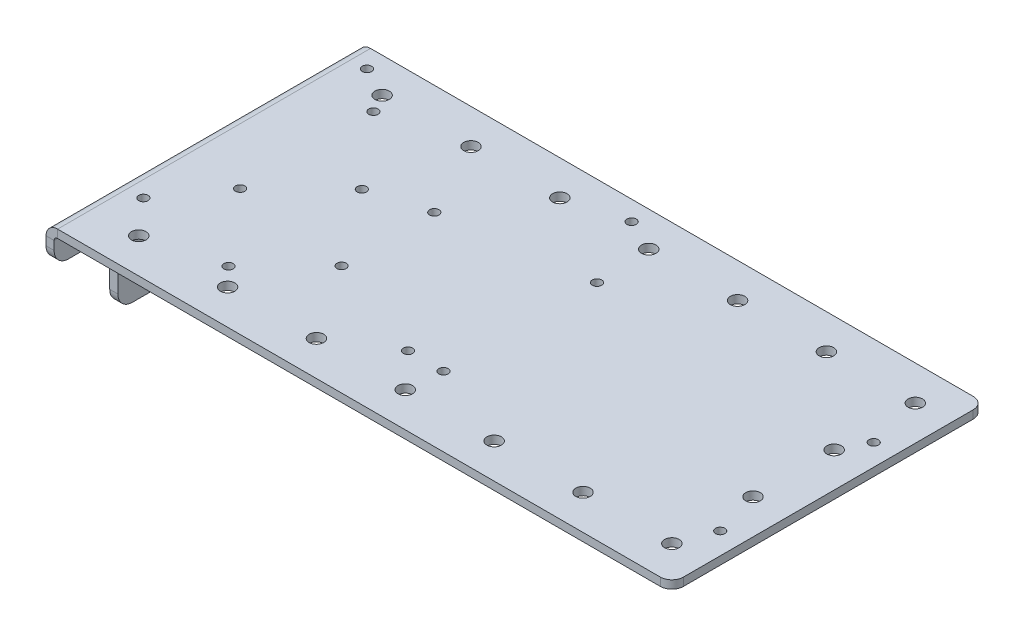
ISO-10303-21;
HEADER;
FILE_DESCRIPTION(('STEP AP214'),'2;1');
FILE_NAME('part.step','',(''),(''),'','','');
FILE_SCHEMA(('AUTOMOTIVE_DESIGN { 1 0 10303 214 1 1 1 1 }'));
ENDSEC;
DATA;
#1=APPLICATION_CONTEXT('core data for automotive mechanical design processes');
#2=APPLICATION_PROTOCOL_DEFINITION('international standard','automotive_design',2000,#1);
#3=PRODUCT_CONTEXT('',#1,'mechanical');
#4=PRODUCT('Part','Part','',(#3));
#5=PRODUCT_RELATED_PRODUCT_CATEGORY('part','',(#4));
#6=PRODUCT_DEFINITION_FORMATION('','',#4);
#7=PRODUCT_DEFINITION_CONTEXT('part definition',#1,'design');
#8=PRODUCT_DEFINITION('design','',#6,#7);
#9=PRODUCT_DEFINITION_SHAPE('','',#8);
#10=(LENGTH_UNIT() NAMED_UNIT(*) SI_UNIT(.MILLI.,.METRE.));
#11=(NAMED_UNIT(*) PLANE_ANGLE_UNIT() SI_UNIT($,.RADIAN.));
#12=(NAMED_UNIT(*) SI_UNIT($,.STERADIAN.) SOLID_ANGLE_UNIT());
#13=UNCERTAINTY_MEASURE_WITH_UNIT(LENGTH_MEASURE(1.E-05),#10,'distance_accuracy_value','');
#14=(GEOMETRIC_REPRESENTATION_CONTEXT(3) GLOBAL_UNCERTAINTY_ASSIGNED_CONTEXT((#13)) GLOBAL_UNIT_ASSIGNED_CONTEXT((#10,
#11,#12)) REPRESENTATION_CONTEXT('',''));
#15=CARTESIAN_POINT('',(0.,0.,0.));
#16=DIRECTION('',(0.,0.,1.));
#17=DIRECTION('',(1.,0.,0.));
#18=AXIS2_PLACEMENT_3D('',#15,#16,#17);
#19=CARTESIAN_POINT('',(0.,-22.86,34.29));
#20=DIRECTION('',(0.,1.,0.));
#21=DIRECTION('',(-1.,0.,0.));
#22=AXIS2_PLACEMENT_3D('',#19,#20,#21);
#23=PLANE('',#22);
#24=DIRECTION('',(0.,0.,1.));
#25=VECTOR('',#24,1.);
#26=CARTESIAN_POINT('',(0.,-22.86,0.));
#27=LINE('',#26,#25);
#28=CARTESIAN_POINT('',(0.,-22.86,13.1523201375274));
#29=VERTEX_POINT('',#28);
#30=CARTESIAN_POINT('',(0.,-22.86,17.145));
#31=VERTEX_POINT('',#30);
#32=EDGE_CURVE('E482',#29,#31,#27,.T.);
#33=ORIENTED_EDGE('',*,*,#32,.F.);
#34=DIRECTION('',(1.,0.,0.));
#35=VECTOR('',#34,1.);
#36=CARTESIAN_POINT('',(0.,-22.86,13.1523201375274));
#37=LINE('',#36,#35);
#38=CARTESIAN_POINT('',(1.77799999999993,-22.86,13.1523201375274));
#39=VERTEX_POINT('',#38);
#40=EDGE_CURVE('E598',#29,#39,#37,.T.);
#41=ORIENTED_EDGE('',*,*,#40,.T.);
#42=DIRECTION('',(0.,0.,-1.));
#43=VECTOR('',#42,1.);
#44=CARTESIAN_POINT('',(1.77799999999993,-22.86,34.29));
#45=LINE('',#44,#43);
#46=CARTESIAN_POINT('',(1.77799999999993,-22.86,17.145));
#47=VERTEX_POINT('',#46);
#48=EDGE_CURVE('E491',#39,#47,#45,.F.);
#49=ORIENTED_EDGE('',*,*,#48,.T.);
#50=DIRECTION('',(-1.,0.,0.));
#51=VECTOR('',#50,1.);
#52=CARTESIAN_POINT('',(0.,-22.86,17.145));
#53=LINE('',#52,#51);
#54=EDGE_CURVE('E595',#47,#31,#53,.T.);
#55=ORIENTED_EDGE('',*,*,#54,.T.);
#56=EDGE_LOOP('',(#33,#41,#49,#55));
#57=FACE_BOUND('',#56,.T.);
#58=ADVANCED_FACE('F63',(#57),#23,.F.);
#59=CARTESIAN_POINT('',(0.,-1.778,0.));
#60=DIRECTION('',(0.,1.,0.));
#61=DIRECTION('',(0.,0.,1.));
#62=AXIS2_PLACEMENT_3D('',#59,#60,#61);
#63=PLANE('',#62);
#64=CARTESIAN_POINT('',(12.6999999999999,-1.778,26.67));
#65=DIRECTION('',(0.,-1.,0.));
#66=DIRECTION('',(0.,0.,-1.));
#67=AXIS2_PLACEMENT_3D('',#64,#65,#66);
#68=CIRCLE('',#67,1.5875);
#69=CARTESIAN_POINT('',(12.6999999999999,-1.778,25.0825));
#70=VERTEX_POINT('',#69);
#71=EDGE_CURVE('E283',#70,#70,#68,.T.);
#72=ORIENTED_EDGE('',*,*,#71,.F.);
#73=EDGE_LOOP('',(#72));
#74=FACE_BOUND('',#73,.T.);
#75=CARTESIAN_POINT('',(32.1733333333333,-1.778,26.67));
#76=DIRECTION('',(0.,-1.,0.));
#77=DIRECTION('',(0.,0.,-1.));
#78=AXIS2_PLACEMENT_3D('',#75,#76,#77);
#79=CIRCLE('',#78,1.5875);
#80=CARTESIAN_POINT('',(32.1733333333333,-1.778,25.0825));
#81=VERTEX_POINT('',#80);
#82=EDGE_CURVE('E291',#81,#81,#79,.T.);
#83=ORIENTED_EDGE('',*,*,#82,.F.);
#84=EDGE_LOOP('',(#83));
#85=FACE_BOUND('',#84,.T.);
#86=CARTESIAN_POINT('',(51.6466666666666,-1.778,26.67));
#87=DIRECTION('',(0.,-1.,0.));
#88=DIRECTION('',(0.,0.,-1.));
#89=AXIS2_PLACEMENT_3D('',#86,#87,#88);
#90=CIRCLE('',#89,1.5875);
#91=CARTESIAN_POINT('',(51.6466666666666,-1.778,25.0825));
#92=VERTEX_POINT('',#91);
#93=EDGE_CURVE('E297',#92,#92,#90,.T.);
#94=ORIENTED_EDGE('',*,*,#93,.F.);
#95=EDGE_LOOP('',(#94));
#96=FACE_BOUND('',#95,.T.);
#97=CARTESIAN_POINT('',(71.12,-1.778,26.67));
#98=DIRECTION('',(0.,-1.,0.));
#99=DIRECTION('',(0.,0.,-1.));
#100=AXIS2_PLACEMENT_3D('',#97,#98,#99);
#101=CIRCLE('',#100,1.58750000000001);
#102=CARTESIAN_POINT('',(71.12,-1.778,25.0825));
#103=VERTEX_POINT('',#102);
#104=EDGE_CURVE('E303',#103,#103,#101,.T.);
#105=ORIENTED_EDGE('',*,*,#104,.F.);
#106=EDGE_LOOP('',(#105));
#107=FACE_BOUND('',#106,.T.);
#108=CARTESIAN_POINT('',(90.5933333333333,-1.778,26.67));
#109=DIRECTION('',(0.,-1.,0.));
#110=DIRECTION('',(0.,0.,-1.));
#111=AXIS2_PLACEMENT_3D('',#108,#109,#110);
#112=CIRCLE('',#111,1.58750000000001);
#113=CARTESIAN_POINT('',(90.5933333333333,-1.778,25.0825));
#114=VERTEX_POINT('',#113);
#115=EDGE_CURVE('E309',#114,#114,#112,.T.);
#116=ORIENTED_EDGE('',*,*,#115,.F.);
#117=EDGE_LOOP('',(#116));
#118=FACE_BOUND('',#117,.T.);
#119=CARTESIAN_POINT('',(129.54,-1.778,26.67));
#120=DIRECTION('',(0.,-1.,0.));
#121=DIRECTION('',(0.,0.,-1.));
#122=AXIS2_PLACEMENT_3D('',#119,#120,#121);
#123=CIRCLE('',#122,1.58749999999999);
#124=CARTESIAN_POINT('',(129.54,-1.778,25.0825));
#125=VERTEX_POINT('',#124);
#126=EDGE_CURVE('E321',#125,#125,#123,.T.);
#127=ORIENTED_EDGE('',*,*,#126,.F.);
#128=EDGE_LOOP('',(#127));
#129=FACE_BOUND('',#128,.T.);
#130=CARTESIAN_POINT('',(129.54,-1.778,-8.89));
#131=DIRECTION('',(0.,-1.,0.));
#132=DIRECTION('',(0.,0.,-1.));
#133=AXIS2_PLACEMENT_3D('',#130,#131,#132);
#134=CIRCLE('',#133,1.58749999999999);
#135=CARTESIAN_POINT('',(129.54,-1.778,-10.4775));
#136=VERTEX_POINT('',#135);
#137=EDGE_CURVE('E333',#136,#136,#134,.T.);
#138=ORIENTED_EDGE('',*,*,#137,.F.);
#139=EDGE_LOOP('',(#138));
#140=FACE_BOUND('',#139,.T.);
#141=CARTESIAN_POINT('',(129.54,-1.778,-26.67));
#142=DIRECTION('',(0.,-1.,0.));
#143=DIRECTION('',(0.,0.,-1.));
#144=AXIS2_PLACEMENT_3D('',#141,#142,#143);
#145=CIRCLE('',#144,1.58749999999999);
#146=CARTESIAN_POINT('',(129.54,-1.778,-28.2575));
#147=VERTEX_POINT('',#146);
#148=EDGE_CURVE('E339',#147,#147,#145,.T.);
#149=ORIENTED_EDGE('',*,*,#148,.F.);
#150=EDGE_LOOP('',(#149));
#151=FACE_BOUND('',#150,.T.);
#152=CARTESIAN_POINT('',(110.066666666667,-1.778,-26.67));
#153=DIRECTION('',(0.,-1.,0.));
#154=DIRECTION('',(0.,0.,-1.));
#155=AXIS2_PLACEMENT_3D('',#152,#153,#154);
#156=CIRCLE('',#155,1.58750000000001);
#157=CARTESIAN_POINT('',(110.066666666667,-1.778,-28.2575));
#158=VERTEX_POINT('',#157);
#159=EDGE_CURVE('E345',#158,#158,#156,.T.);
#160=ORIENTED_EDGE('',*,*,#159,.F.);
#161=EDGE_LOOP('',(#160));
#162=FACE_BOUND('',#161,.T.);
#163=CARTESIAN_POINT('',(90.5933333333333,-1.778,-26.67));
#164=DIRECTION('',(0.,-1.,0.));
#165=DIRECTION('',(0.,0.,-1.));
#166=AXIS2_PLACEMENT_3D('',#163,#164,#165);
#167=CIRCLE('',#166,1.58750000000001);
#168=CARTESIAN_POINT('',(90.5933333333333,-1.778,-28.2575));
#169=VERTEX_POINT('',#168);
#170=EDGE_CURVE('E351',#169,#169,#167,.T.);
#171=ORIENTED_EDGE('',*,*,#170,.F.);
#172=EDGE_LOOP('',(#171));
#173=FACE_BOUND('',#172,.T.);
#174=CARTESIAN_POINT('',(71.12,-1.778,-26.67));
#175=DIRECTION('',(0.,-1.,0.));
#176=DIRECTION('',(0.,0.,-1.));
#177=AXIS2_PLACEMENT_3D('',#174,#175,#176);
#178=CIRCLE('',#177,1.58750000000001);
#179=CARTESIAN_POINT('',(71.12,-1.778,-28.2575));
#180=VERTEX_POINT('',#179);
#181=EDGE_CURVE('E357',#180,#180,#178,.T.);
#182=ORIENTED_EDGE('',*,*,#181,.F.);
#183=EDGE_LOOP('',(#182));
#184=FACE_BOUND('',#183,.T.);
#185=CARTESIAN_POINT('',(51.6466666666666,-1.778,-26.67));
#186=DIRECTION('',(0.,-1.,0.));
#187=DIRECTION('',(0.,0.,-1.));
#188=AXIS2_PLACEMENT_3D('',#185,#186,#187);
#189=CIRCLE('',#188,1.5875);
#190=CARTESIAN_POINT('',(51.6466666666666,-1.778,-28.2575));
#191=VERTEX_POINT('',#190);
#192=EDGE_CURVE('E363',#191,#191,#189,.T.);
#193=ORIENTED_EDGE('',*,*,#192,.F.);
#194=EDGE_LOOP('',(#193));
#195=FACE_BOUND('',#194,.T.);
#196=CARTESIAN_POINT('',(32.1733333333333,-1.778,-26.67));
#197=DIRECTION('',(0.,-1.,0.));
#198=DIRECTION('',(0.,0.,-1.));
#199=AXIS2_PLACEMENT_3D('',#196,#197,#198);
#200=CIRCLE('',#199,1.5875);
#201=CARTESIAN_POINT('',(32.1733333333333,-1.778,-28.2575));
#202=VERTEX_POINT('',#201);
#203=EDGE_CURVE('E369',#202,#202,#200,.T.);
#204=ORIENTED_EDGE('',*,*,#203,.F.);
#205=EDGE_LOOP('',(#204));
#206=FACE_BOUND('',#205,.T.);
#207=CARTESIAN_POINT('',(12.6999999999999,-1.778,-26.67));
#208=DIRECTION('',(0.,-1.,0.));
#209=DIRECTION('',(0.,0.,-1.));
#210=AXIS2_PLACEMENT_3D('',#207,#208,#209);
#211=CIRCLE('',#210,1.5875);
#212=CARTESIAN_POINT('',(12.6999999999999,-1.778,-28.2575));
#213=VERTEX_POINT('',#212);
#214=EDGE_CURVE('E375',#213,#213,#211,.T.);
#215=ORIENTED_EDGE('',*,*,#214,.F.);
#216=EDGE_LOOP('',(#215));
#217=FACE_BOUND('',#216,.T.);
#218=CARTESIAN_POINT('',(6.04000000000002,-1.778,-30.0118000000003));
#219=DIRECTION('',(0.,1.,0.));
#220=DIRECTION('',(0.,0.,1.));
#221=AXIS2_PLACEMENT_3D('',#218,#219,#220);
#222=CIRCLE('',#221,1.025);
#223=CARTESIAN_POINT('',(6.04000000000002,-1.778,-28.9868000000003));
#224=VERTEX_POINT('',#223);
#225=EDGE_CURVE('E384',#224,#224,#222,.T.);
#226=ORIENTED_EDGE('',*,*,#225,.T.);
#227=EDGE_LOOP('',(#226));
#228=FACE_BOUND('',#227,.T.);
#229=CARTESIAN_POINT('',(64.04,-1.778,-30.0118000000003));
#230=DIRECTION('',(0.,1.,0.));
#231=DIRECTION('',(0.,0.,1.));
#232=AXIS2_PLACEMENT_3D('',#229,#230,#231);
#233=CIRCLE('',#232,1.025);
#234=CARTESIAN_POINT('',(64.04,-1.778,-28.9868000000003));
#235=VERTEX_POINT('',#234);
#236=EDGE_CURVE('E390',#235,#235,#233,.T.);
#237=ORIENTED_EDGE('',*,*,#236,.T.);
#238=EDGE_LOOP('',(#237));
#239=FACE_BOUND('',#238,.T.);
#240=CARTESIAN_POINT('',(64.04,-1.778,18.9881999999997));
#241=DIRECTION('',(0.,1.,0.));
#242=DIRECTION('',(0.,0.,1.));
#243=AXIS2_PLACEMENT_3D('',#240,#241,#242);
#244=CIRCLE('',#243,1.025);
#245=CARTESIAN_POINT('',(64.04,-1.778,20.0131999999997));
#246=VERTEX_POINT('',#245);
#247=EDGE_CURVE('E396',#246,#246,#244,.T.);
#248=ORIENTED_EDGE('',*,*,#247,.T.);
#249=EDGE_LOOP('',(#248));
#250=FACE_BOUND('',#249,.T.);
#251=CARTESIAN_POINT('',(6.04000000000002,-1.778,18.9881999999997));
#252=DIRECTION('',(0.,1.,0.));
#253=DIRECTION('',(0.,0.,1.));
#254=AXIS2_PLACEMENT_3D('',#251,#252,#253);
#255=CIRCLE('',#254,1.025);
#256=CARTESIAN_POINT('',(6.04000000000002,-1.778,20.0131999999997));
#257=VERTEX_POINT('',#256);
#258=EDGE_CURVE('E402',#257,#257,#255,.T.);
#259=ORIENTED_EDGE('',*,*,#258,.T.);
#260=EDGE_LOOP('',(#259));
#261=FACE_BOUND('',#260,.T.);
#262=CARTESIAN_POINT('',(71.8025016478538,-1.778,18.980699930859));
#263=DIRECTION('',(0.,-1.,0.));
#264=DIRECTION('',(0.,0.,-1.));
#265=AXIS2_PLACEMENT_3D('',#262,#263,#264);
#266=CIRCLE('',#265,1.025);
#267=CARTESIAN_POINT('',(71.8025016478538,-1.778,17.955699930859));
#268=VERTEX_POINT('',#267);
#269=EDGE_CURVE('E417',#268,#268,#266,.T.);
#270=ORIENTED_EDGE('',*,*,#269,.F.);
#271=EDGE_LOOP('',(#270));
#272=FACE_BOUND('',#271,.T.);
#273=CARTESIAN_POINT('',(71.7994994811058,-1.778,-14.661799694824));
#274=DIRECTION('',(0.,-1.,0.));
#275=DIRECTION('',(0.,0.,-1.));
#276=AXIS2_PLACEMENT_3D('',#273,#274,#275);
#277=CIRCLE('',#276,1.025);
#278=CARTESIAN_POINT('',(71.7994994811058,-1.778,-15.686799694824));
#279=VERTEX_POINT('',#278);
#280=EDGE_CURVE('E423',#279,#279,#277,.T.);
#281=ORIENTED_EDGE('',*,*,#280,.F.);
#282=EDGE_LOOP('',(#281));
#283=FACE_BOUND('',#282,.T.);
#284=CARTESIAN_POINT('',(132.440499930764,-1.778,-14.658301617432));
#285=DIRECTION('',(0.,-1.,0.));
#286=DIRECTION('',(0.,0.,-1.));
#287=AXIS2_PLACEMENT_3D('',#284,#285,#286);
#288=CIRCLE('',#287,1.025);
#289=CARTESIAN_POINT('',(132.440499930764,-1.778,-15.683301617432));
#290=VERTEX_POINT('',#289);
#291=EDGE_CURVE('E429',#290,#290,#288,.T.);
#292=ORIENTED_EDGE('',*,*,#291,.F.);
#293=EDGE_LOOP('',(#292));
#294=FACE_BOUND('',#293,.T.);
#295=CARTESIAN_POINT('',(132.440499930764,-1.778,18.976699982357));
#296=DIRECTION('',(0.,-1.,0.));
#297=DIRECTION('',(0.,0.,-1.));
#298=AXIS2_PLACEMENT_3D('',#295,#296,#297);
#299=CIRCLE('',#298,1.025);
#300=CARTESIAN_POINT('',(132.440499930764,-1.778,17.951699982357));
#301=VERTEX_POINT('',#300);
#302=EDGE_CURVE('E435',#301,#301,#299,.T.);
#303=ORIENTED_EDGE('',*,*,#302,.F.);
#304=EDGE_LOOP('',(#303));
#305=FACE_BOUND('',#304,.T.);
#306=CARTESIAN_POINT('',(40.6400000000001,-1.778,-10.1600000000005));
#307=DIRECTION('',(0.,-1.,0.));
#308=DIRECTION('',(0.,0.,-1.));
#309=AXIS2_PLACEMENT_3D('',#306,#307,#308);
#310=CIRCLE('',#309,1.025);
#311=CARTESIAN_POINT('',(40.6400000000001,-1.778,-11.1850000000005));
#312=VERTEX_POINT('',#311);
#313=EDGE_CURVE('E441',#312,#312,#310,.T.);
#314=ORIENTED_EDGE('',*,*,#313,.F.);
#315=EDGE_LOOP('',(#314));
#316=FACE_BOUND('',#315,.T.);
#317=CARTESIAN_POINT('',(40.6399999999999,-1.778,10.1599999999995));
#318=DIRECTION('',(0.,-1.,0.));
#319=DIRECTION('',(0.,0.,-1.));
#320=AXIS2_PLACEMENT_3D('',#317,#318,#319);
#321=CIRCLE('',#320,1.025);
#322=CARTESIAN_POINT('',(40.6399999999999,-1.778,9.13499999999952));
#323=VERTEX_POINT('',#322);
#324=EDGE_CURVE('E447',#323,#323,#321,.T.);
#325=ORIENTED_EDGE('',*,*,#324,.F.);
#326=EDGE_LOOP('',(#325));
#327=FACE_BOUND('',#326,.T.);
#328=CARTESIAN_POINT('',(14.8589999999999,-1.778,-22.606));
#329=DIRECTION('',(0.,-1.,0.));
#330=DIRECTION('',(0.,0.,-1.));
#331=AXIS2_PLACEMENT_3D('',#328,#329,#330);
#332=CIRCLE('',#331,1.025);
#333=CARTESIAN_POINT('',(14.8589999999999,-1.778,-23.631));
#334=VERTEX_POINT('',#333);
#335=EDGE_CURVE('E453',#334,#334,#332,.T.);
#336=ORIENTED_EDGE('',*,*,#335,.F.);
#337=EDGE_LOOP('',(#336));
#338=FACE_BOUND('',#337,.T.);
#339=CARTESIAN_POINT('',(28.3209999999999,-1.778,-6.604));
#340=DIRECTION('',(0.,-1.,0.));
#341=DIRECTION('',(0.,0.,-1.));
#342=AXIS2_PLACEMENT_3D('',#339,#340,#341);
#343=CIRCLE('',#342,1.025);
#344=CARTESIAN_POINT('',(28.3209999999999,-1.778,-7.629));
#345=VERTEX_POINT('',#344);
#346=EDGE_CURVE('E459',#345,#345,#343,.T.);
#347=ORIENTED_EDGE('',*,*,#346,.F.);
#348=EDGE_LOOP('',(#347));
#349=FACE_BOUND('',#348,.T.);
#350=CARTESIAN_POINT('',(14.8589999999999,-1.778,6.604));
#351=DIRECTION('',(0.,-1.,0.));
#352=DIRECTION('',(0.,0.,-1.));
#353=AXIS2_PLACEMENT_3D('',#350,#351,#352);
#354=CIRCLE('',#353,1.025);
#355=CARTESIAN_POINT('',(14.8589999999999,-1.778,5.579));
#356=VERTEX_POINT('',#355);
#357=EDGE_CURVE('E465',#356,#356,#354,.T.);
#358=ORIENTED_EDGE('',*,*,#357,.F.);
#359=EDGE_LOOP('',(#358));
#360=FACE_BOUND('',#359,.T.);
#361=CARTESIAN_POINT('',(28.3209999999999,-1.778,22.606));
#362=DIRECTION('',(0.,-1.,0.));
#363=DIRECTION('',(0.,0.,-1.));
#364=AXIS2_PLACEMENT_3D('',#361,#362,#363);
#365=CIRCLE('',#364,1.025);
#366=CARTESIAN_POINT('',(28.3209999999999,-1.778,21.581));
#367=VERTEX_POINT('',#366);
#368=EDGE_CURVE('E471',#367,#367,#365,.T.);
#369=ORIENTED_EDGE('',*,*,#368,.F.);
#370=EDGE_LOOP('',(#369));
#371=FACE_BOUND('',#370,.T.);
#372=DIRECTION('',(0.,0.,-1.));
#373=VECTOR('',#372,1.);
#374=CARTESIAN_POINT('',(137.16,-1.778,-34.29));
#375=LINE('',#374,#373);
#376=CARTESIAN_POINT('',(137.16,-1.778,31.75));
#377=VERTEX_POINT('',#376);
#378=CARTESIAN_POINT('',(137.16,-1.778,-31.75));
#379=VERTEX_POINT('',#378);
#380=EDGE_CURVE('E533',#377,#379,#375,.T.);
#381=ORIENTED_EDGE('',*,*,#380,.F.);
#382=CARTESIAN_POINT('',(134.62,-1.778,31.75));
#383=DIRECTION('',(0.,1.,0.));
#384=DIRECTION('',(0.,0.,1.));
#385=AXIS2_PLACEMENT_3D('',#382,#383,#384);
#386=CIRCLE('',#385,2.54);
#387=CARTESIAN_POINT('',(134.62,-1.778,34.29));
#388=VERTEX_POINT('',#387);
#389=EDGE_CURVE('E559',#377,#388,#386,.F.);
#390=ORIENTED_EDGE('',*,*,#389,.T.);
#391=DIRECTION('',(1.,0.,0.));
#392=VECTOR('',#391,1.);
#393=CARTESIAN_POINT('',(0.,-1.778,34.29));
#394=LINE('',#393,#392);
#395=CARTESIAN_POINT('',(2.54,-1.778,34.29));
#396=VERTEX_POINT('',#395);
#397=EDGE_CURVE('E530',#396,#388,#394,.T.);
#398=ORIENTED_EDGE('',*,*,#397,.F.);
#399=DIRECTION('',(0.,0.,-1.));
#400=VECTOR('',#399,1.);
#401=CARTESIAN_POINT('',(2.54,-1.778,-34.29));
#402=LINE('',#401,#400);
#403=CARTESIAN_POINT('',(2.54,-1.778,-34.29));
#404=VERTEX_POINT('',#403);
#405=EDGE_CURVE('E520',#404,#396,#402,.F.);
#406=ORIENTED_EDGE('',*,*,#405,.F.);
#407=DIRECTION('',(-1.,0.,0.));
#408=VECTOR('',#407,1.);
#409=CARTESIAN_POINT('',(0.,-1.778,-34.29));
#410=LINE('',#409,#408);
#411=CARTESIAN_POINT('',(134.62,-1.778,-34.29));
#412=VERTEX_POINT('',#411);
#413=EDGE_CURVE('E537',#412,#404,#410,.T.);
#414=ORIENTED_EDGE('',*,*,#413,.F.);
#415=CARTESIAN_POINT('',(134.62,-1.778,-31.75));
#416=DIRECTION('',(0.,1.,0.));
#417=DIRECTION('',(0.,0.,1.));
#418=AXIS2_PLACEMENT_3D('',#415,#416,#417);
#419=CIRCLE('',#418,2.54);
#420=EDGE_CURVE('E557',#412,#379,#419,.F.);
#421=ORIENTED_EDGE('',*,*,#420,.T.);
#422=EDGE_LOOP('',(#381,#390,#398,#406,#414,#421));
#423=FACE_BOUND('',#422,.T.);
#424=CARTESIAN_POINT('',(129.54,-1.778,8.89));
#425=DIRECTION('',(0.,-1.,0.));
#426=DIRECTION('',(0.,0.,-1.));
#427=AXIS2_PLACEMENT_3D('',#424,#425,#426);
#428=CIRCLE('',#427,1.58749999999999);
#429=CARTESIAN_POINT('',(129.54,-1.778,7.30250000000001));
#430=VERTEX_POINT('',#429);
#431=EDGE_CURVE('E327',#430,#430,#428,.T.);
#432=ORIENTED_EDGE('',*,*,#431,.F.);
#433=EDGE_LOOP('',(#432));
#434=FACE_BOUND('',#433,.T.);
#435=CARTESIAN_POINT('',(110.066666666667,-1.778,26.67));
#436=DIRECTION('',(0.,-1.,0.));
#437=DIRECTION('',(0.,0.,-1.));
#438=AXIS2_PLACEMENT_3D('',#435,#436,#437);
#439=CIRCLE('',#438,1.58750000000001);
#440=CARTESIAN_POINT('',(110.066666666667,-1.778,25.0825));
#441=VERTEX_POINT('',#440);
#442=EDGE_CURVE('E315',#441,#441,#439,.T.);
#443=ORIENTED_EDGE('',*,*,#442,.F.);
#444=EDGE_LOOP('',(#443));
#445=FACE_BOUND('',#444,.T.);
#446=ADVANCED_FACE('F653',(#74,#85,#96,#107,#118,#129,#140,#151,#162,#173,#184,#195,#206,#217,
#228,#239,#250,#261,#272,#283,#294,#305,#316,#327,#338,#349,#360,#371,#423,#434,#445),#63,.F.);
#447=CARTESIAN_POINT('',(0.,0.,0.));
#448=DIRECTION('',(0.,1.,0.));
#449=DIRECTION('',(0.,0.,1.));
#450=AXIS2_PLACEMENT_3D('',#447,#448,#449);
#451=PLANE('',#450);
#452=CARTESIAN_POINT('',(12.6999999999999,0.,26.67));
#453=DIRECTION('',(0.,-1.,0.));
#454=DIRECTION('',(0.,0.,-1.));
#455=AXIS2_PLACEMENT_3D('',#452,#453,#454);
#456=CIRCLE('',#455,1.5875);
#457=CARTESIAN_POINT('',(12.6999999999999,0.,25.0825));
#458=VERTEX_POINT('',#457);
#459=EDGE_CURVE('E288',#458,#458,#456,.T.);
#460=ORIENTED_EDGE('',*,*,#459,.T.);
#461=EDGE_LOOP('',(#460));
#462=FACE_BOUND('',#461,.T.);
#463=CARTESIAN_POINT('',(32.1733333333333,0.,26.67));
#464=DIRECTION('',(0.,-1.,0.));
#465=DIRECTION('',(0.,0.,-1.));
#466=AXIS2_PLACEMENT_3D('',#463,#464,#465);
#467=CIRCLE('',#466,1.5875);
#468=CARTESIAN_POINT('',(32.1733333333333,0.,25.0825));
#469=VERTEX_POINT('',#468);
#470=EDGE_CURVE('E294',#469,#469,#467,.T.);
#471=ORIENTED_EDGE('',*,*,#470,.T.);
#472=EDGE_LOOP('',(#471));
#473=FACE_BOUND('',#472,.T.);
#474=CARTESIAN_POINT('',(51.6466666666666,0.,26.67));
#475=DIRECTION('',(0.,-1.,0.));
#476=DIRECTION('',(0.,0.,-1.));
#477=AXIS2_PLACEMENT_3D('',#474,#475,#476);
#478=CIRCLE('',#477,1.5875);
#479=CARTESIAN_POINT('',(51.6466666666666,0.,25.0825));
#480=VERTEX_POINT('',#479);
#481=EDGE_CURVE('E300',#480,#480,#478,.T.);
#482=ORIENTED_EDGE('',*,*,#481,.T.);
#483=EDGE_LOOP('',(#482));
#484=FACE_BOUND('',#483,.T.);
#485=CARTESIAN_POINT('',(71.12,0.,26.67));
#486=DIRECTION('',(0.,-1.,0.));
#487=DIRECTION('',(0.,0.,-1.));
#488=AXIS2_PLACEMENT_3D('',#485,#486,#487);
#489=CIRCLE('',#488,1.58750000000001);
#490=CARTESIAN_POINT('',(71.12,0.,25.0825));
#491=VERTEX_POINT('',#490);
#492=EDGE_CURVE('E306',#491,#491,#489,.T.);
#493=ORIENTED_EDGE('',*,*,#492,.T.);
#494=EDGE_LOOP('',(#493));
#495=FACE_BOUND('',#494,.T.);
#496=CARTESIAN_POINT('',(90.5933333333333,0.,26.67));
#497=DIRECTION('',(0.,-1.,0.));
#498=DIRECTION('',(0.,0.,-1.));
#499=AXIS2_PLACEMENT_3D('',#496,#497,#498);
#500=CIRCLE('',#499,1.58750000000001);
#501=CARTESIAN_POINT('',(90.5933333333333,0.,25.0825));
#502=VERTEX_POINT('',#501);
#503=EDGE_CURVE('E312',#502,#502,#500,.T.);
#504=ORIENTED_EDGE('',*,*,#503,.T.);
#505=EDGE_LOOP('',(#504));
#506=FACE_BOUND('',#505,.T.);
#507=CARTESIAN_POINT('',(110.066666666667,0.,26.67));
#508=DIRECTION('',(0.,-1.,0.));
#509=DIRECTION('',(0.,0.,-1.));
#510=AXIS2_PLACEMENT_3D('',#507,#508,#509);
#511=CIRCLE('',#510,1.58750000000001);
#512=CARTESIAN_POINT('',(110.066666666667,0.,25.0825));
#513=VERTEX_POINT('',#512);
#514=EDGE_CURVE('E318',#513,#513,#511,.T.);
#515=ORIENTED_EDGE('',*,*,#514,.T.);
#516=EDGE_LOOP('',(#515));
#517=FACE_BOUND('',#516,.T.);
#518=CARTESIAN_POINT('',(129.54,0.,26.67));
#519=DIRECTION('',(0.,-1.,0.));
#520=DIRECTION('',(0.,0.,-1.));
#521=AXIS2_PLACEMENT_3D('',#518,#519,#520);
#522=CIRCLE('',#521,1.58749999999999);
#523=CARTESIAN_POINT('',(129.54,0.,25.0825));
#524=VERTEX_POINT('',#523);
#525=EDGE_CURVE('E324',#524,#524,#522,.T.);
#526=ORIENTED_EDGE('',*,*,#525,.T.);
#527=EDGE_LOOP('',(#526));
#528=FACE_BOUND('',#527,.T.);
#529=DIRECTION('',(1.,0.,0.));
#530=VECTOR('',#529,1.);
#531=CARTESIAN_POINT('',(0.,0.,34.29));
#532=LINE('',#531,#530);
#533=CARTESIAN_POINT('',(2.54,0.,34.29));
#534=VERTEX_POINT('',#533);
#535=CARTESIAN_POINT('',(134.62,0.,34.29));
#536=VERTEX_POINT('',#535);
#537=EDGE_CURVE('E527',#534,#536,#532,.T.);
#538=ORIENTED_EDGE('',*,*,#537,.T.);
#539=CARTESIAN_POINT('',(134.62,0.,31.75));
#540=DIRECTION('',(0.,1.,0.));
#541=DIRECTION('',(0.,0.,1.));
#542=AXIS2_PLACEMENT_3D('',#539,#540,#541);
#543=CIRCLE('',#542,2.54);
#544=CARTESIAN_POINT('',(137.16,0.,31.75));
#545=VERTEX_POINT('',#544);
#546=EDGE_CURVE('E550',#536,#545,#543,.T.);
#547=ORIENTED_EDGE('',*,*,#546,.T.);
#548=DIRECTION('',(0.,0.,-1.));
#549=VECTOR('',#548,1.);
#550=CARTESIAN_POINT('',(137.16,0.,-34.29));
#551=LINE('',#550,#549);
#552=CARTESIAN_POINT('',(137.16,0.,-31.75));
#553=VERTEX_POINT('',#552);
#554=EDGE_CURVE('E542',#545,#553,#551,.T.);
#555=ORIENTED_EDGE('',*,*,#554,.T.);
#556=CARTESIAN_POINT('',(134.62,0.,-31.75));
#557=DIRECTION('',(0.,1.,0.));
#558=DIRECTION('',(0.,0.,1.));
#559=AXIS2_PLACEMENT_3D('',#556,#557,#558);
#560=CIRCLE('',#559,2.54);
#561=CARTESIAN_POINT('',(134.62,0.,-34.29));
#562=VERTEX_POINT('',#561);
#563=EDGE_CURVE('E548',#553,#562,#560,.T.);
#564=ORIENTED_EDGE('',*,*,#563,.T.);
#565=DIRECTION('',(-1.,0.,0.));
#566=VECTOR('',#565,1.);
#567=CARTESIAN_POINT('',(0.,0.,-34.29));
#568=LINE('',#567,#566);
#569=CARTESIAN_POINT('',(2.54,0.,-34.29));
#570=VERTEX_POINT('',#569);
#571=EDGE_CURVE('E534',#562,#570,#568,.T.);
#572=ORIENTED_EDGE('',*,*,#571,.T.);
#573=DIRECTION('',(0.,0.,-1.));
#574=VECTOR('',#573,1.);
#575=CARTESIAN_POINT('',(2.54,0.,-34.29));
#576=LINE('',#575,#574);
#577=EDGE_CURVE('E507',#570,#534,#576,.F.);
#578=ORIENTED_EDGE('',*,*,#577,.T.);
#579=EDGE_LOOP('',(#538,#547,#555,#564,#572,#578));
#580=FACE_BOUND('',#579,.T.);
#581=CARTESIAN_POINT('',(28.3209999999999,0.,22.606));
#582=DIRECTION('',(0.,-1.,0.));
#583=DIRECTION('',(0.,0.,-1.));
#584=AXIS2_PLACEMENT_3D('',#581,#582,#583);
#585=CIRCLE('',#584,1.025);
#586=CARTESIAN_POINT('',(28.3209999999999,0.,21.581));
#587=VERTEX_POINT('',#586);
#588=EDGE_CURVE('E474',#587,#587,#585,.T.);
#589=ORIENTED_EDGE('',*,*,#588,.T.);
#590=EDGE_LOOP('',(#589));
#591=FACE_BOUND('',#590,.T.);
#592=CARTESIAN_POINT('',(14.8589999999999,0.,6.604));
#593=DIRECTION('',(0.,-1.,0.));
#594=DIRECTION('',(0.,0.,-1.));
#595=AXIS2_PLACEMENT_3D('',#592,#593,#594);
#596=CIRCLE('',#595,1.025);
#597=CARTESIAN_POINT('',(14.8589999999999,0.,5.579));
#598=VERTEX_POINT('',#597);
#599=EDGE_CURVE('E468',#598,#598,#596,.T.);
#600=ORIENTED_EDGE('',*,*,#599,.T.);
#601=EDGE_LOOP('',(#600));
#602=FACE_BOUND('',#601,.T.);
#603=CARTESIAN_POINT('',(28.3209999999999,0.,-6.604));
#604=DIRECTION('',(0.,-1.,0.));
#605=DIRECTION('',(0.,0.,-1.));
#606=AXIS2_PLACEMENT_3D('',#603,#604,#605);
#607=CIRCLE('',#606,1.025);
#608=CARTESIAN_POINT('',(28.3209999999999,0.,-7.629));
#609=VERTEX_POINT('',#608);
#610=EDGE_CURVE('E462',#609,#609,#607,.T.);
#611=ORIENTED_EDGE('',*,*,#610,.T.);
#612=EDGE_LOOP('',(#611));
#613=FACE_BOUND('',#612,.T.);
#614=CARTESIAN_POINT('',(14.8589999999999,0.,-22.606));
#615=DIRECTION('',(0.,-1.,0.));
#616=DIRECTION('',(0.,0.,-1.));
#617=AXIS2_PLACEMENT_3D('',#614,#615,#616);
#618=CIRCLE('',#617,1.025);
#619=CARTESIAN_POINT('',(14.8589999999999,0.,-23.631));
#620=VERTEX_POINT('',#619);
#621=EDGE_CURVE('E456',#620,#620,#618,.T.);
#622=ORIENTED_EDGE('',*,*,#621,.T.);
#623=EDGE_LOOP('',(#622));
#624=FACE_BOUND('',#623,.T.);
#625=CARTESIAN_POINT('',(40.6399999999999,0.,10.1599999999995));
#626=DIRECTION('',(0.,-1.,0.));
#627=DIRECTION('',(0.,0.,-1.));
#628=AXIS2_PLACEMENT_3D('',#625,#626,#627);
#629=CIRCLE('',#628,1.025);
#630=CARTESIAN_POINT('',(40.6399999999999,0.,9.13499999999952));
#631=VERTEX_POINT('',#630);
#632=EDGE_CURVE('E450',#631,#631,#629,.T.);
#633=ORIENTED_EDGE('',*,*,#632,.T.);
#634=EDGE_LOOP('',(#633));
#635=FACE_BOUND('',#634,.T.);
#636=CARTESIAN_POINT('',(40.6400000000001,0.,-10.1600000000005));
#637=DIRECTION('',(0.,-1.,0.));
#638=DIRECTION('',(0.,0.,-1.));
#639=AXIS2_PLACEMENT_3D('',#636,#637,#638);
#640=CIRCLE('',#639,1.025);
#641=CARTESIAN_POINT('',(40.6400000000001,0.,-11.1850000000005));
#642=VERTEX_POINT('',#641);
#643=EDGE_CURVE('E444',#642,#642,#640,.T.);
#644=ORIENTED_EDGE('',*,*,#643,.T.);
#645=EDGE_LOOP('',(#644));
#646=FACE_BOUND('',#645,.T.);
#647=CARTESIAN_POINT('',(132.440499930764,0.,18.976699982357));
#648=DIRECTION('',(0.,-1.,0.));
#649=DIRECTION('',(0.,0.,-1.));
#650=AXIS2_PLACEMENT_3D('',#647,#648,#649);
#651=CIRCLE('',#650,1.025);
#652=CARTESIAN_POINT('',(132.440499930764,0.,17.951699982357));
#653=VERTEX_POINT('',#652);
#654=EDGE_CURVE('E438',#653,#653,#651,.T.);
#655=ORIENTED_EDGE('',*,*,#654,.T.);
#656=EDGE_LOOP('',(#655));
#657=FACE_BOUND('',#656,.T.);
#658=CARTESIAN_POINT('',(132.440499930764,0.,-14.658301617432));
#659=DIRECTION('',(0.,-1.,0.));
#660=DIRECTION('',(0.,0.,-1.));
#661=AXIS2_PLACEMENT_3D('',#658,#659,#660);
#662=CIRCLE('',#661,1.025);
#663=CARTESIAN_POINT('',(132.440499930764,0.,-15.683301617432));
#664=VERTEX_POINT('',#663);
#665=EDGE_CURVE('E432',#664,#664,#662,.T.);
#666=ORIENTED_EDGE('',*,*,#665,.T.);
#667=EDGE_LOOP('',(#666));
#668=FACE_BOUND('',#667,.T.);
#669=CARTESIAN_POINT('',(71.7994994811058,0.,-14.661799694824));
#670=DIRECTION('',(0.,-1.,0.));
#671=DIRECTION('',(0.,0.,-1.));
#672=AXIS2_PLACEMENT_3D('',#669,#670,#671);
#673=CIRCLE('',#672,1.025);
#674=CARTESIAN_POINT('',(71.7994994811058,0.,-15.686799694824));
#675=VERTEX_POINT('',#674);
#676=EDGE_CURVE('E426',#675,#675,#673,.T.);
#677=ORIENTED_EDGE('',*,*,#676,.T.);
#678=EDGE_LOOP('',(#677));
#679=FACE_BOUND('',#678,.T.);
#680=CARTESIAN_POINT('',(71.8025016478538,0.,18.980699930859));
#681=DIRECTION('',(0.,-1.,0.));
#682=DIRECTION('',(0.,0.,-1.));
#683=AXIS2_PLACEMENT_3D('',#680,#681,#682);
#684=CIRCLE('',#683,1.025);
#685=CARTESIAN_POINT('',(71.8025016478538,0.,17.955699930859));
#686=VERTEX_POINT('',#685);
#687=EDGE_CURVE('E420',#686,#686,#684,.T.);
#688=ORIENTED_EDGE('',*,*,#687,.T.);
#689=EDGE_LOOP('',(#688));
#690=FACE_BOUND('',#689,.T.);
#691=CARTESIAN_POINT('',(6.04000000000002,0.,18.9881999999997));
#692=DIRECTION('',(0.,1.,0.));
#693=DIRECTION('',(0.,0.,1.));
#694=AXIS2_PLACEMENT_3D('',#691,#692,#693);
#695=CIRCLE('',#694,1.025);
#696=CARTESIAN_POINT('',(6.04000000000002,0.,20.0131999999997));
#697=VERTEX_POINT('',#696);
#698=EDGE_CURVE('E399',#697,#697,#695,.T.);
#699=ORIENTED_EDGE('',*,*,#698,.F.);
#700=EDGE_LOOP('',(#699));
#701=FACE_BOUND('',#700,.T.);
#702=CARTESIAN_POINT('',(64.04,0.,18.9881999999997));
#703=DIRECTION('',(0.,1.,0.));
#704=DIRECTION('',(0.,0.,1.));
#705=AXIS2_PLACEMENT_3D('',#702,#703,#704);
#706=CIRCLE('',#705,1.025);
#707=CARTESIAN_POINT('',(64.04,0.,20.0131999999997));
#708=VERTEX_POINT('',#707);
#709=EDGE_CURVE('E393',#708,#708,#706,.T.);
#710=ORIENTED_EDGE('',*,*,#709,.F.);
#711=EDGE_LOOP('',(#710));
#712=FACE_BOUND('',#711,.T.);
#713=CARTESIAN_POINT('',(64.04,0.,-30.0118000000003));
#714=DIRECTION('',(0.,1.,0.));
#715=DIRECTION('',(0.,0.,1.));
#716=AXIS2_PLACEMENT_3D('',#713,#714,#715);
#717=CIRCLE('',#716,1.025);
#718=CARTESIAN_POINT('',(64.04,0.,-28.9868000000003));
#719=VERTEX_POINT('',#718);
#720=EDGE_CURVE('E387',#719,#719,#717,.T.);
#721=ORIENTED_EDGE('',*,*,#720,.F.);
#722=EDGE_LOOP('',(#721));
#723=FACE_BOUND('',#722,.T.);
#724=CARTESIAN_POINT('',(6.04000000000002,0.,-30.0118000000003));
#725=DIRECTION('',(0.,1.,0.));
#726=DIRECTION('',(0.,0.,1.));
#727=AXIS2_PLACEMENT_3D('',#724,#725,#726);
#728=CIRCLE('',#727,1.025);
#729=CARTESIAN_POINT('',(6.04000000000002,0.,-28.9868000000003));
#730=VERTEX_POINT('',#729);
#731=EDGE_CURVE('E381',#730,#730,#728,.T.);
#732=ORIENTED_EDGE('',*,*,#731,.F.);
#733=EDGE_LOOP('',(#732));
#734=FACE_BOUND('',#733,.T.);
#735=CARTESIAN_POINT('',(12.6999999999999,0.,-26.67));
#736=DIRECTION('',(0.,-1.,0.));
#737=DIRECTION('',(0.,0.,-1.));
#738=AXIS2_PLACEMENT_3D('',#735,#736,#737);
#739=CIRCLE('',#738,1.5875);
#740=CARTESIAN_POINT('',(12.6999999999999,0.,-28.2575));
#741=VERTEX_POINT('',#740);
#742=EDGE_CURVE('E378',#741,#741,#739,.T.);
#743=ORIENTED_EDGE('',*,*,#742,.T.);
#744=EDGE_LOOP('',(#743));
#745=FACE_BOUND('',#744,.T.);
#746=CARTESIAN_POINT('',(32.1733333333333,0.,-26.67));
#747=DIRECTION('',(0.,-1.,0.));
#748=DIRECTION('',(0.,0.,-1.));
#749=AXIS2_PLACEMENT_3D('',#746,#747,#748);
#750=CIRCLE('',#749,1.5875);
#751=CARTESIAN_POINT('',(32.1733333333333,0.,-28.2575));
#752=VERTEX_POINT('',#751);
#753=EDGE_CURVE('E372',#752,#752,#750,.T.);
#754=ORIENTED_EDGE('',*,*,#753,.T.);
#755=EDGE_LOOP('',(#754));
#756=FACE_BOUND('',#755,.T.);
#757=CARTESIAN_POINT('',(51.6466666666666,0.,-26.67));
#758=DIRECTION('',(0.,-1.,0.));
#759=DIRECTION('',(0.,0.,-1.));
#760=AXIS2_PLACEMENT_3D('',#757,#758,#759);
#761=CIRCLE('',#760,1.5875);
#762=CARTESIAN_POINT('',(51.6466666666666,0.,-28.2575));
#763=VERTEX_POINT('',#762);
#764=EDGE_CURVE('E366',#763,#763,#761,.T.);
#765=ORIENTED_EDGE('',*,*,#764,.T.);
#766=EDGE_LOOP('',(#765));
#767=FACE_BOUND('',#766,.T.);
#768=CARTESIAN_POINT('',(71.12,0.,-26.67));
#769=DIRECTION('',(0.,-1.,0.));
#770=DIRECTION('',(0.,0.,-1.));
#771=AXIS2_PLACEMENT_3D('',#768,#769,#770);
#772=CIRCLE('',#771,1.58750000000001);
#773=CARTESIAN_POINT('',(71.12,0.,-28.2575));
#774=VERTEX_POINT('',#773);
#775=EDGE_CURVE('E360',#774,#774,#772,.T.);
#776=ORIENTED_EDGE('',*,*,#775,.T.);
#777=EDGE_LOOP('',(#776));
#778=FACE_BOUND('',#777,.T.);
#779=CARTESIAN_POINT('',(90.5933333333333,0.,-26.67));
#780=DIRECTION('',(0.,-1.,0.));
#781=DIRECTION('',(0.,0.,-1.));
#782=AXIS2_PLACEMENT_3D('',#779,#780,#781);
#783=CIRCLE('',#782,1.58750000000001);
#784=CARTESIAN_POINT('',(90.5933333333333,0.,-28.2575));
#785=VERTEX_POINT('',#784);
#786=EDGE_CURVE('E354',#785,#785,#783,.T.);
#787=ORIENTED_EDGE('',*,*,#786,.T.);
#788=EDGE_LOOP('',(#787));
#789=FACE_BOUND('',#788,.T.);
#790=CARTESIAN_POINT('',(110.066666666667,0.,-26.67));
#791=DIRECTION('',(0.,-1.,0.));
#792=DIRECTION('',(0.,0.,-1.));
#793=AXIS2_PLACEMENT_3D('',#790,#791,#792);
#794=CIRCLE('',#793,1.58750000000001);
#795=CARTESIAN_POINT('',(110.066666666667,0.,-28.2575));
#796=VERTEX_POINT('',#795);
#797=EDGE_CURVE('E348',#796,#796,#794,.T.);
#798=ORIENTED_EDGE('',*,*,#797,.T.);
#799=EDGE_LOOP('',(#798));
#800=FACE_BOUND('',#799,.T.);
#801=CARTESIAN_POINT('',(129.54,0.,-26.67));
#802=DIRECTION('',(0.,-1.,0.));
#803=DIRECTION('',(0.,0.,-1.));
#804=AXIS2_PLACEMENT_3D('',#801,#802,#803);
#805=CIRCLE('',#804,1.58749999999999);
#806=CARTESIAN_POINT('',(129.54,0.,-28.2575));
#807=VERTEX_POINT('',#806);
#808=EDGE_CURVE('E342',#807,#807,#805,.T.);
#809=ORIENTED_EDGE('',*,*,#808,.T.);
#810=EDGE_LOOP('',(#809));
#811=FACE_BOUND('',#810,.T.);
#812=CARTESIAN_POINT('',(129.54,0.,-8.89));
#813=DIRECTION('',(0.,-1.,0.));
#814=DIRECTION('',(0.,0.,-1.));
#815=AXIS2_PLACEMENT_3D('',#812,#813,#814);
#816=CIRCLE('',#815,1.58749999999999);
#817=CARTESIAN_POINT('',(129.54,0.,-10.4775));
#818=VERTEX_POINT('',#817);
#819=EDGE_CURVE('E336',#818,#818,#816,.T.);
#820=ORIENTED_EDGE('',*,*,#819,.T.);
#821=EDGE_LOOP('',(#820));
#822=FACE_BOUND('',#821,.T.);
#823=CARTESIAN_POINT('',(129.54,0.,8.89));
#824=DIRECTION('',(0.,-1.,0.));
#825=DIRECTION('',(0.,0.,-1.));
#826=AXIS2_PLACEMENT_3D('',#823,#824,#825);
#827=CIRCLE('',#826,1.58749999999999);
#828=CARTESIAN_POINT('',(129.54,0.,7.30250000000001));
#829=VERTEX_POINT('',#828);
#830=EDGE_CURVE('E330',#829,#829,#827,.T.);
#831=ORIENTED_EDGE('',*,*,#830,.T.);
#832=EDGE_LOOP('',(#831));
#833=FACE_BOUND('',#832,.T.);
#834=ADVANCED_FACE('F664',(#462,#473,#484,#495,#506,#517,#528,#580,#591,#602,#613,#624,#635,
#646,#657,#668,#679,#690,#701,#712,#723,#734,#745,#756,#767,#778,#789,#800,#811,#822,#833),#451,.T.);
#835=CARTESIAN_POINT('',(0.,-1.778,-34.29));
#836=DIRECTION('',(0.,0.,-1.));
#837=DIRECTION('',(-1.,0.,0.));
#838=AXIS2_PLACEMENT_3D('',#835,#836,#837);
#839=PLANE('',#838);
#840=ORIENTED_EDGE('',*,*,#571,.F.);
#841=DIRECTION('',(0.,1.,0.));
#842=VECTOR('',#841,1.);
#843=CARTESIAN_POINT('',(134.62,-1.778,-34.29));
#844=LINE('',#843,#842);
#845=EDGE_CURVE('E561',#562,#412,#844,.F.);
#846=ORIENTED_EDGE('',*,*,#845,.T.);
#847=ORIENTED_EDGE('',*,*,#413,.T.);
#848=DIRECTION('',(0.,1.,0.));
#849=VECTOR('',#848,1.);
#850=CARTESIAN_POINT('',(2.54,-1.778,-34.29));
#851=LINE('',#850,#849);
#852=EDGE_CURVE('E514',#404,#570,#851,.T.);
#853=ORIENTED_EDGE('',*,*,#852,.T.);
#854=EDGE_LOOP('',(#840,#846,#847,#853));
#855=FACE_BOUND('',#854,.T.);
#856=ADVANCED_FACE('F647',(#855),#839,.T.);
#857=CARTESIAN_POINT('',(137.16,-1.778,-34.29));
#858=DIRECTION('',(1.,0.,0.));
#859=DIRECTION('',(0.,0.,-1.));
#860=AXIS2_PLACEMENT_3D('',#857,#858,#859);
#861=PLANE('',#860);
#862=ORIENTED_EDGE('',*,*,#554,.F.);
#863=DIRECTION('',(0.,1.,0.));
#864=VECTOR('',#863,1.);
#865=CARTESIAN_POINT('',(137.16,-1.778,31.75));
#866=LINE('',#865,#864);
#867=EDGE_CURVE('E555',#545,#377,#866,.F.);
#868=ORIENTED_EDGE('',*,*,#867,.T.);
#869=ORIENTED_EDGE('',*,*,#380,.T.);
#870=DIRECTION('',(0.,1.,0.));
#871=VECTOR('',#870,1.);
#872=CARTESIAN_POINT('',(137.16,-1.778,-31.75));
#873=LINE('',#872,#871);
#874=EDGE_CURVE('E552',#379,#553,#873,.T.);
#875=ORIENTED_EDGE('',*,*,#874,.T.);
#876=EDGE_LOOP('',(#862,#868,#869,#875));
#877=FACE_BOUND('',#876,.T.);
#878=ADVANCED_FACE('F661',(#877),#861,.T.);
#879=CARTESIAN_POINT('',(0.,-1.778,34.29));
#880=DIRECTION('',(0.,0.,1.));
#881=DIRECTION('',(1.,0.,0.));
#882=AXIS2_PLACEMENT_3D('',#879,#880,#881);
#883=PLANE('',#882);
#884=ORIENTED_EDGE('',*,*,#397,.T.);
#885=DIRECTION('',(0.,1.,0.));
#886=VECTOR('',#885,1.);
#887=CARTESIAN_POINT('',(134.62,-1.778,34.29));
#888=LINE('',#887,#886);
#889=EDGE_CURVE('E539',#388,#536,#888,.T.);
#890=ORIENTED_EDGE('',*,*,#889,.T.);
#891=ORIENTED_EDGE('',*,*,#537,.F.);
#892=DIRECTION('',(0.,1.,0.));
#893=VECTOR('',#892,1.);
#894=CARTESIAN_POINT('',(2.54,-1.778,34.29));
#895=LINE('',#894,#893);
#896=EDGE_CURVE('E524',#396,#534,#895,.T.);
#897=ORIENTED_EDGE('',*,*,#896,.F.);
#898=EDGE_LOOP('',(#884,#890,#891,#897));
#899=FACE_BOUND('',#898,.T.);
#900=ADVANCED_FACE('F672',(#899),#883,.T.);
#901=CARTESIAN_POINT('',(2.54,-2.54,34.29));
#902=DIRECTION('',(0.,0.,1.));
#903=DIRECTION('',(1.,0.,0.));
#904=AXIS2_PLACEMENT_3D('',#901,#902,#903);
#905=PLANE('',#904);
#906=DIRECTION('',(1.,0.,0.));
#907=VECTOR('',#906,1.);
#908=CARTESIAN_POINT('',(0.,-2.53999999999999,34.29));
#909=LINE('',#908,#907);
#910=CARTESIAN_POINT('',(1.778,-2.54,34.29));
#911=VERTEX_POINT('',#910);
#912=CARTESIAN_POINT('',(0.,-2.53999999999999,34.29));
#913=VERTEX_POINT('',#912);
#914=EDGE_CURVE('E477',#911,#913,#909,.F.);
#915=ORIENTED_EDGE('',*,*,#914,.F.);
#916=CARTESIAN_POINT('',(2.54,-2.54,34.29));
#917=DIRECTION('',(0.,0.,-1.));
#918=DIRECTION('',(-1.,0.,0.));
#919=AXIS2_PLACEMENT_3D('',#916,#917,#918);
#920=CIRCLE('',#919,0.762);
#921=EDGE_CURVE('E517',#396,#911,#920,.F.);
#922=ORIENTED_EDGE('',*,*,#921,.F.);
#923=ORIENTED_EDGE('',*,*,#896,.T.);
#924=CARTESIAN_POINT('',(2.54,-2.54,34.29));
#925=DIRECTION('',(0.,0.,-1.));
#926=DIRECTION('',(-1.,0.,0.));
#927=AXIS2_PLACEMENT_3D('',#924,#925,#926);
#928=CIRCLE('',#927,2.54);
#929=EDGE_CURVE('E510',#534,#913,#928,.F.);
#930=ORIENTED_EDGE('',*,*,#929,.T.);
#931=EDGE_LOOP('',(#915,#922,#923,#930));
#932=FACE_BOUND('',#931,.T.);
#933=ADVANCED_FACE('F632',(#932),#905,.T.);
#934=CARTESIAN_POINT('',(2.54,-2.54,-34.29));
#935=DIRECTION('',(0.,0.,1.));
#936=DIRECTION('',(1.,0.,0.));
#937=AXIS2_PLACEMENT_3D('',#934,#935,#936);
#938=PLANE('',#937);
#939=CARTESIAN_POINT('',(2.54,-2.54,-34.29));
#940=DIRECTION('',(0.,0.,-1.));
#941=DIRECTION('',(-1.,0.,0.));
#942=AXIS2_PLACEMENT_3D('',#939,#940,#941);
#943=CIRCLE('',#942,0.762);
#944=CARTESIAN_POINT('',(1.778,-2.54,-34.29));
#945=VERTEX_POINT('',#944);
#946=EDGE_CURVE('E480',#945,#404,#943,.T.);
#947=ORIENTED_EDGE('',*,*,#946,.F.);
#948=DIRECTION('',(1.,0.,0.));
#949=VECTOR('',#948,1.);
#950=CARTESIAN_POINT('',(1.778,-2.54,-34.29));
#951=LINE('',#950,#949);
#952=CARTESIAN_POINT('',(0.,-2.53999999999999,-34.29));
#953=VERTEX_POINT('',#952);
#954=EDGE_CURVE('E500',#945,#953,#951,.F.);
#955=ORIENTED_EDGE('',*,*,#954,.T.);
#956=CARTESIAN_POINT('',(2.54,-2.54,-34.29));
#957=DIRECTION('',(0.,0.,-1.));
#958=DIRECTION('',(-1.,0.,0.));
#959=AXIS2_PLACEMENT_3D('',#956,#957,#958);
#960=CIRCLE('',#959,2.54);
#961=EDGE_CURVE('E511',#953,#570,#960,.T.);
#962=ORIENTED_EDGE('',*,*,#961,.T.);
#963=ORIENTED_EDGE('',*,*,#852,.F.);
#964=EDGE_LOOP('',(#947,#955,#962,#963));
#965=FACE_BOUND('',#964,.T.);
#966=ADVANCED_FACE('F644',(#965),#938,.F.);
#967=CARTESIAN_POINT('',(2.54,-2.54,-34.29));
#968=DIRECTION('',(0.,0.,-1.));
#969=DIRECTION('',(-1.,0.,0.));
#970=AXIS2_PLACEMENT_3D('',#967,#968,#969);
#971=CYLINDRICAL_SURFACE('',#970,2.54);
#972=ORIENTED_EDGE('',*,*,#577,.F.);
#973=ORIENTED_EDGE('',*,*,#961,.F.);
#974=DIRECTION('',(0.,0.,-1.));
#975=VECTOR('',#974,1.);
#976=CARTESIAN_POINT('',(0.,-2.53999999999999,34.29));
#977=LINE('',#976,#975);
#978=EDGE_CURVE('E497',#953,#913,#977,.F.);
#979=ORIENTED_EDGE('',*,*,#978,.T.);
#980=ORIENTED_EDGE('',*,*,#929,.F.);
#981=EDGE_LOOP('',(#972,#973,#979,#980));
#982=FACE_BOUND('',#981,.T.);
#983=ADVANCED_FACE('F629',(#982),#971,.T.);
#984=CARTESIAN_POINT('',(2.54,-2.54,-34.29));
#985=DIRECTION('',(0.,0.,-1.));
#986=DIRECTION('',(-1.,0.,0.));
#987=AXIS2_PLACEMENT_3D('',#984,#985,#986);
#988=CYLINDRICAL_SURFACE('',#987,0.762);
#989=ORIENTED_EDGE('',*,*,#405,.T.);
#990=ORIENTED_EDGE('',*,*,#921,.T.);
#991=DIRECTION('',(0.,0.,-1.));
#992=VECTOR('',#991,1.);
#993=CARTESIAN_POINT('',(1.778,-2.54,34.29));
#994=LINE('',#993,#992);
#995=EDGE_CURVE('E503',#911,#945,#994,.T.);
#996=ORIENTED_EDGE('',*,*,#995,.T.);
#997=ORIENTED_EDGE('',*,*,#946,.T.);
#998=EDGE_LOOP('',(#989,#990,#996,#997));
#999=FACE_BOUND('',#998,.T.);
#1000=ADVANCED_FACE('F640',(#999),#988,.F.);
#1001=CARTESIAN_POINT('',(0.,-22.86,-34.29));
#1002=DIRECTION('',(0.,0.,1.));
#1003=DIRECTION('',(0.,-1.,0.));
#1004=AXIS2_PLACEMENT_3D('',#1001,#1002,#1003);
#1005=PLANE('',#1004);
#1006=DIRECTION('',(0.,1.,0.));
#1007=VECTOR('',#1006,1.);
#1008=CARTESIAN_POINT('',(1.77799999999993,-22.86,-34.29));
#1009=LINE('',#1008,#1007);
#1010=CARTESIAN_POINT('',(1.778,-4.44499999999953,-34.29));
#1011=VERTEX_POINT('',#1010);
#1012=EDGE_CURVE('E494',#945,#1011,#1009,.F.);
#1013=ORIENTED_EDGE('',*,*,#1012,.T.);
#1014=DIRECTION('',(-1.,0.,0.));
#1015=VECTOR('',#1014,1.);
#1016=CARTESIAN_POINT('',(0.,-4.44499999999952,-34.29));
#1017=LINE('',#1016,#1015);
#1018=CARTESIAN_POINT('',(0.,-4.44499999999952,-34.29));
#1019=VERTEX_POINT('',#1018);
#1020=EDGE_CURVE('E607',#1011,#1019,#1017,.T.);
#1021=ORIENTED_EDGE('',*,*,#1020,.T.);
#1022=DIRECTION('',(0.,-1.,0.));
#1023=VECTOR('',#1022,1.);
#1024=CARTESIAN_POINT('',(0.,0.,-34.29));
#1025=LINE('',#1024,#1023);
#1026=EDGE_CURVE('E485',#953,#1019,#1025,.T.);
#1027=ORIENTED_EDGE('',*,*,#1026,.F.);
#1028=ORIENTED_EDGE('',*,*,#954,.F.);
#1029=EDGE_LOOP('',(#1013,#1021,#1027,#1028));
#1030=FACE_BOUND('',#1029,.T.);
#1031=ADVANCED_FACE('F620',(#1030),#1005,.F.);
#1032=CARTESIAN_POINT('',(0.,-1.77799999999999,34.29));
#1033=DIRECTION('',(0.,0.,-1.));
#1034=DIRECTION('',(-1.,0.,0.));
#1035=AXIS2_PLACEMENT_3D('',#1032,#1033,#1034);
#1036=PLANE('',#1035);
#1037=DIRECTION('',(0.,1.,0.));
#1038=VECTOR('',#1037,1.);
#1039=CARTESIAN_POINT('',(0.,0.,34.29));
#1040=LINE('',#1039,#1038);
#1041=CARTESIAN_POINT('',(0.,-4.44499999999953,34.29));
#1042=VERTEX_POINT('',#1041);
#1043=EDGE_CURVE('E478',#1042,#913,#1040,.T.);
#1044=ORIENTED_EDGE('',*,*,#1043,.F.);
#1045=DIRECTION('',(1.,0.,0.));
#1046=VECTOR('',#1045,1.);
#1047=CARTESIAN_POINT('',(0.,-4.44499999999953,34.29));
#1048=LINE('',#1047,#1046);
#1049=CARTESIAN_POINT('',(1.778,-4.44499999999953,34.29));
#1050=VERTEX_POINT('',#1049);
#1051=EDGE_CURVE('E603',#1042,#1050,#1048,.T.);
#1052=ORIENTED_EDGE('',*,*,#1051,.T.);
#1053=DIRECTION('',(0.,-1.,0.));
#1054=VECTOR('',#1053,1.);
#1055=CARTESIAN_POINT('',(1.77800000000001,-1.778,34.29));
#1056=LINE('',#1055,#1054);
#1057=EDGE_CURVE('E488',#1050,#911,#1056,.F.);
#1058=ORIENTED_EDGE('',*,*,#1057,.T.);
#1059=ORIENTED_EDGE('',*,*,#914,.T.);
#1060=EDGE_LOOP('',(#1044,#1052,#1058,#1059));
#1061=FACE_BOUND('',#1060,.T.);
#1062=ADVANCED_FACE('F636',(#1061),#1036,.F.);
#1063=CARTESIAN_POINT('',(0.,0.,0.));
#1064=DIRECTION('',(1.,0.,0.));
#1065=DIRECTION('',(0.,1.,0.));
#1066=AXIS2_PLACEMENT_3D('',#1063,#1064,#1065);
#1067=PLANE('',#1066);
#1068=CARTESIAN_POINT('',(-1.04300248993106E-13,-17.78,14.2875));
#1069=DIRECTION('',(1.,0.,0.));
#1070=DIRECTION('',(0.,0.,-1.));
#1071=AXIS2_PLACEMENT_3D('',#1068,#1069,#1070);
#1072=CIRCLE('',#1071,2.15265);
#1073=CARTESIAN_POINT('',(-1.04300248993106E-13,-17.78,12.13485));
#1074=VERTEX_POINT('',#1073);
#1075=EDGE_CURVE('E408',#1074,#1074,#1072,.T.);
#1076=ORIENTED_EDGE('',*,*,#1075,.T.);
#1077=EDGE_LOOP('',(#1076));
#1078=FACE_BOUND('',#1077,.T.);
#1079=CARTESIAN_POINT('',(-1.04300248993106E-13,-17.78,-14.2875));
#1080=DIRECTION('',(1.,0.,0.));
#1081=DIRECTION('',(0.,0.,-1.));
#1082=AXIS2_PLACEMENT_3D('',#1079,#1080,#1081);
#1083=CIRCLE('',#1082,2.15265);
#1084=CARTESIAN_POINT('',(-1.04300248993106E-13,-17.78,-16.44015));
#1085=VERTEX_POINT('',#1084);
#1086=EDGE_CURVE('E414',#1085,#1085,#1083,.T.);
#1087=ORIENTED_EDGE('',*,*,#1086,.T.);
#1088=EDGE_LOOP('',(#1087));
#1089=FACE_BOUND('',#1088,.T.);
#1090=CARTESIAN_POINT('',(0.,-22.86,-17.145));
#1091=VERTEX_POINT('',#1090);
#1092=CARTESIAN_POINT('',(0.,-22.86,-13.1523201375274));
#1093=VERTEX_POINT('',#1092);
#1094=EDGE_CURVE('E481',#1091,#1093,#27,.T.);
#1095=ORIENTED_EDGE('',*,*,#1094,.T.);
#1096=CARTESIAN_POINT('',(0.,-19.685,-13.1523201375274));
#1097=DIRECTION('',(1.,0.,0.));
#1098=DIRECTION('',(0.,1.,0.));
#1099=AXIS2_PLACEMENT_3D('',#1096,#1097,#1098);
#1100=CIRCLE('',#1099,3.175);
#1101=CARTESIAN_POINT('',(-1.79215433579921E-13,-21.4629999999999,-10.5218561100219));
#1102=VERTEX_POINT('',#1101);
#1103=EDGE_CURVE('E579',#1093,#1102,#1100,.F.);
#1104=ORIENTED_EDGE('',*,*,#1103,.T.);
#1105=CARTESIAN_POINT('',(-2.04046848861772E-13,-28.5749999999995,0.));
#1106=DIRECTION('',(1.,0.,0.));
#1107=DIRECTION('',(0.,1.,0.));
#1108=AXIS2_PLACEMENT_3D('',#1105,#1106,#1107);
#1109=CIRCLE('',#1108,12.7);
#1110=CARTESIAN_POINT('',(-1.79215433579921E-13,-21.4629999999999,10.5218561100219));
#1111=VERTEX_POINT('',#1110);
#1112=EDGE_CURVE('E280',#1102,#1111,#1109,.T.);
#1113=ORIENTED_EDGE('',*,*,#1112,.T.);
#1114=CARTESIAN_POINT('',(0.,-19.685,13.1523201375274));
#1115=DIRECTION('',(1.,0.,0.));
#1116=DIRECTION('',(0.,1.,0.));
#1117=AXIS2_PLACEMENT_3D('',#1114,#1115,#1116);
#1118=CIRCLE('',#1117,3.175);
#1119=EDGE_CURVE('E577',#1111,#29,#1118,.F.);
#1120=ORIENTED_EDGE('',*,*,#1119,.T.);
#1121=ORIENTED_EDGE('',*,*,#32,.T.);
#1122=CARTESIAN_POINT('',(0.,-19.685,17.145));
#1123=DIRECTION('',(1.,0.,0.));
#1124=DIRECTION('',(0.,1.,0.));
#1125=AXIS2_PLACEMENT_3D('',#1122,#1123,#1124);
#1126=CIRCLE('',#1125,3.175);
#1127=CARTESIAN_POINT('',(-1.73022363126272E-13,-19.685,20.32));
#1128=VERTEX_POINT('',#1127);
#1129=EDGE_CURVE('E575',#31,#1128,#1126,.F.);
#1130=ORIENTED_EDGE('',*,*,#1129,.T.);
#1131=DIRECTION('',(0.,1.,0.));
#1132=VECTOR('',#1131,1.);
#1133=CARTESIAN_POINT('',(-2.01011082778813E-13,-27.6762488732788,20.32));
#1134=LINE('',#1133,#1132);
#1135=CARTESIAN_POINT('',(-1.47668335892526E-13,-12.4459999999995,20.32));
#1136=VERTEX_POINT('',#1135);
#1137=EDGE_CURVE('E263',#1128,#1136,#1134,.T.);
#1138=ORIENTED_EDGE('',*,*,#1137,.T.);
#1139=CARTESIAN_POINT('',(-1.47668335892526E-13,-12.4459999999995,25.146));
#1140=DIRECTION('',(1.,0.,0.));
#1141=DIRECTION('',(0.,1.,0.));
#1142=AXIS2_PLACEMENT_3D('',#1139,#1140,#1141);
#1143=CIRCLE('',#1142,4.826);
#1144=CARTESIAN_POINT('',(-1.30971622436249E-13,-7.61999999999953,25.146));
#1145=VERTEX_POINT('',#1144);
#1146=EDGE_CURVE('E270',#1136,#1145,#1143,.T.);
#1147=ORIENTED_EDGE('',*,*,#1146,.T.);
#1148=DIRECTION('',(0.,0.,1.));
#1149=VECTOR('',#1148,1.);
#1150=CARTESIAN_POINT('',(-1.30971622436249E-13,-7.61999999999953,25.146));
#1151=LINE('',#1150,#1149);
#1152=CARTESIAN_POINT('',(-1.30971622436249E-13,-7.61999999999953,31.115));
#1153=VERTEX_POINT('',#1152);
#1154=EDGE_CURVE('E275',#1145,#1153,#1151,.T.);
#1155=ORIENTED_EDGE('',*,*,#1154,.T.);
#1156=CARTESIAN_POINT('',(0.,-4.44499999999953,31.115));
#1157=DIRECTION('',(1.,0.,0.));
#1158=DIRECTION('',(0.,1.,0.));
#1159=AXIS2_PLACEMENT_3D('',#1156,#1157,#1158);
#1160=CIRCLE('',#1159,3.175);
#1161=EDGE_CURVE('E573',#1153,#1042,#1160,.F.);
#1162=ORIENTED_EDGE('',*,*,#1161,.T.);
#1163=ORIENTED_EDGE('',*,*,#1043,.T.);
#1164=ORIENTED_EDGE('',*,*,#978,.F.);
#1165=ORIENTED_EDGE('',*,*,#1026,.T.);
#1166=CARTESIAN_POINT('',(0.,-4.44499999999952,-31.115));
#1167=DIRECTION('',(1.,0.,0.));
#1168=DIRECTION('',(0.,1.,0.));
#1169=AXIS2_PLACEMENT_3D('',#1166,#1167,#1168);
#1170=CIRCLE('',#1169,3.175);
#1171=CARTESIAN_POINT('',(-1.30971622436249E-13,-7.61999999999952,-31.115));
#1172=VERTEX_POINT('',#1171);
#1173=EDGE_CURVE('E571',#1019,#1172,#1170,.F.);
#1174=ORIENTED_EDGE('',*,*,#1173,.T.);
#1175=DIRECTION('',(0.,0.,1.));
#1176=VECTOR('',#1175,1.);
#1177=CARTESIAN_POINT('',(-1.30971622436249E-13,-7.61999999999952,-25.146));
#1178=LINE('',#1177,#1176);
#1179=CARTESIAN_POINT('',(-1.30754782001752E-13,-7.61999999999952,-25.146));
#1180=VERTEX_POINT('',#1179);
#1181=EDGE_CURVE('E251',#1172,#1180,#1178,.T.);
#1182=ORIENTED_EDGE('',*,*,#1181,.T.);
#1183=CARTESIAN_POINT('',(-1.47668335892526E-13,-12.4459999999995,-25.146));
#1184=DIRECTION('',(1.,0.,0.));
#1185=DIRECTION('',(0.,-1.,0.));
#1186=AXIS2_PLACEMENT_3D('',#1183,#1184,#1185);
#1187=CIRCLE('',#1186,4.826);
#1188=CARTESIAN_POINT('',(-1.47668335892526E-13,-12.4459999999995,-20.32));
#1189=VERTEX_POINT('',#1188);
#1190=EDGE_CURVE('E253',#1180,#1189,#1187,.T.);
#1191=ORIENTED_EDGE('',*,*,#1190,.T.);
#1192=DIRECTION('',(0.,-1.,0.));
#1193=VECTOR('',#1192,1.);
#1194=CARTESIAN_POINT('',(-2.01011082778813E-13,-27.6762488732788,-20.32));
#1195=LINE('',#1194,#1193);
#1196=CARTESIAN_POINT('',(-1.73022363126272E-13,-19.685,-20.32));
#1197=VERTEX_POINT('',#1196);
#1198=EDGE_CURVE('E231',#1189,#1197,#1195,.T.);
#1199=ORIENTED_EDGE('',*,*,#1198,.T.);
#1200=CARTESIAN_POINT('',(0.,-19.685,-17.145));
#1201=DIRECTION('',(1.,0.,0.));
#1202=DIRECTION('',(0.,1.,0.));
#1203=AXIS2_PLACEMENT_3D('',#1200,#1201,#1202);
#1204=CIRCLE('',#1203,3.175);
#1205=EDGE_CURVE('E569',#1197,#1091,#1204,.F.);
#1206=ORIENTED_EDGE('',*,*,#1205,.T.);
#1207=EDGE_LOOP('',(#1095,#1104,#1113,#1120,#1121,#1130,#1138,#1147,#1155,#1162,#1163,#1164,
#1165,#1174,#1182,#1191,#1199,#1206));
#1208=FACE_BOUND('',#1207,.T.);
#1209=ADVANCED_FACE('F625',(#1078,#1089,#1208),#1067,.F.);
#1210=CARTESIAN_POINT('',(1.77800000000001,0.,0.));
#1211=DIRECTION('',(1.,0.,0.));
#1212=DIRECTION('',(0.,1.,0.));
#1213=AXIS2_PLACEMENT_3D('',#1210,#1211,#1212);
#1214=PLANE('',#1213);
#1215=CARTESIAN_POINT('',(1.77799999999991,-28.5749999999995,0.));
#1216=DIRECTION('',(1.,0.,0.));
#1217=DIRECTION('',(0.,1.,0.));
#1218=AXIS2_PLACEMENT_3D('',#1215,#1216,#1217);
#1219=CIRCLE('',#1218,12.7);
#1220=CARTESIAN_POINT('',(1.77799999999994,-21.4629999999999,-10.5218561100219));
#1221=VERTEX_POINT('',#1220);
#1222=CARTESIAN_POINT('',(1.77799999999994,-21.4629999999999,10.5218561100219));
#1223=VERTEX_POINT('',#1222);
#1224=EDGE_CURVE('E258',#1221,#1223,#1219,.T.);
#1225=ORIENTED_EDGE('',*,*,#1224,.F.);
#1226=CARTESIAN_POINT('',(1.77799999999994,-19.685,-13.1523201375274));
#1227=DIRECTION('',(1.,0.,0.));
#1228=DIRECTION('',(0.,1.,0.));
#1229=AXIS2_PLACEMENT_3D('',#1226,#1227,#1228);
#1230=CIRCLE('',#1229,3.175);
#1231=CARTESIAN_POINT('',(1.77799999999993,-22.86,-13.1523201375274));
#1232=VERTEX_POINT('',#1231);
#1233=EDGE_CURVE('E593',#1221,#1232,#1230,.T.);
#1234=ORIENTED_EDGE('',*,*,#1233,.T.);
#1235=CARTESIAN_POINT('',(1.77799999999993,-22.86,-17.145));
#1236=VERTEX_POINT('',#1235);
#1237=EDGE_CURVE('E490',#1236,#1232,#45,.F.);
#1238=ORIENTED_EDGE('',*,*,#1237,.F.);
#1239=CARTESIAN_POINT('',(1.77799999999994,-19.685,-17.145));
#1240=DIRECTION('',(1.,0.,0.));
#1241=DIRECTION('',(0.,1.,0.));
#1242=AXIS2_PLACEMENT_3D('',#1239,#1240,#1241);
#1243=CIRCLE('',#1242,3.175);
#1244=CARTESIAN_POINT('',(1.77799999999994,-19.685,-20.32));
#1245=VERTEX_POINT('',#1244);
#1246=EDGE_CURVE('E250',#1236,#1245,#1243,.T.);
#1247=ORIENTED_EDGE('',*,*,#1246,.T.);
#1248=DIRECTION('',(0.,-1.,0.));
#1249=VECTOR('',#1248,1.);
#1250=CARTESIAN_POINT('',(1.77799999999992,-27.6762488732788,-20.32));
#1251=LINE('',#1250,#1249);
#1252=CARTESIAN_POINT('',(1.77799999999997,-12.4459999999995,-20.32));
#1253=VERTEX_POINT('',#1252);
#1254=EDGE_CURVE('E228',#1253,#1245,#1251,.T.);
#1255=ORIENTED_EDGE('',*,*,#1254,.F.);
#1256=CARTESIAN_POINT('',(1.77799999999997,-12.4459999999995,-25.146));
#1257=DIRECTION('',(1.,0.,0.));
#1258=DIRECTION('',(0.,-1.,0.));
#1259=AXIS2_PLACEMENT_3D('',#1256,#1257,#1258);
#1260=CIRCLE('',#1259,4.826);
#1261=CARTESIAN_POINT('',(1.77799999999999,-7.61999999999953,-25.146));
#1262=VERTEX_POINT('',#1261);
#1263=EDGE_CURVE('E240',#1262,#1253,#1260,.T.);
#1264=ORIENTED_EDGE('',*,*,#1263,.F.);
#1265=DIRECTION('',(0.,0.,1.));
#1266=VECTOR('',#1265,1.);
#1267=CARTESIAN_POINT('',(1.77799999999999,-7.61999999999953,-25.146));
#1268=LINE('',#1267,#1266);
#1269=CARTESIAN_POINT('',(1.77799999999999,-7.61999999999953,-31.115));
#1270=VERTEX_POINT('',#1269);
#1271=EDGE_CURVE('E244',#1270,#1262,#1268,.T.);
#1272=ORIENTED_EDGE('',*,*,#1271,.F.);
#1273=CARTESIAN_POINT('',(1.778,-4.44499999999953,-31.115));
#1274=DIRECTION('',(1.,0.,0.));
#1275=DIRECTION('',(0.,1.,0.));
#1276=AXIS2_PLACEMENT_3D('',#1273,#1274,#1275);
#1277=CIRCLE('',#1276,3.175);
#1278=EDGE_CURVE('E586',#1270,#1011,#1277,.T.);
#1279=ORIENTED_EDGE('',*,*,#1278,.T.);
#1280=ORIENTED_EDGE('',*,*,#1012,.F.);
#1281=ORIENTED_EDGE('',*,*,#995,.F.);
#1282=ORIENTED_EDGE('',*,*,#1057,.F.);
#1283=CARTESIAN_POINT('',(1.778,-4.44499999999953,31.115));
#1284=DIRECTION('',(1.,0.,0.));
#1285=DIRECTION('',(0.,1.,0.));
#1286=AXIS2_PLACEMENT_3D('',#1283,#1284,#1285);
#1287=CIRCLE('',#1286,3.175);
#1288=CARTESIAN_POINT('',(1.77799999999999,-7.61999999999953,31.115));
#1289=VERTEX_POINT('',#1288);
#1290=EDGE_CURVE('E78',#1050,#1289,#1287,.T.);
#1291=ORIENTED_EDGE('',*,*,#1290,.T.);
#1292=DIRECTION('',(0.,0.,1.));
#1293=VECTOR('',#1292,1.);
#1294=CARTESIAN_POINT('',(1.77799999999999,-7.61999999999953,25.146));
#1295=LINE('',#1294,#1293);
#1296=CARTESIAN_POINT('',(1.77799999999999,-7.61999999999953,25.146));
#1297=VERTEX_POINT('',#1296);
#1298=EDGE_CURVE('E269',#1297,#1289,#1295,.T.);
#1299=ORIENTED_EDGE('',*,*,#1298,.F.);
#1300=CARTESIAN_POINT('',(1.77799999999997,-12.4459999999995,25.146));
#1301=DIRECTION('',(1.,0.,0.));
#1302=DIRECTION('',(0.,1.,0.));
#1303=AXIS2_PLACEMENT_3D('',#1300,#1301,#1302);
#1304=CIRCLE('',#1303,4.826);
#1305=CARTESIAN_POINT('',(1.77799999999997,-12.4459999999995,20.32));
#1306=VERTEX_POINT('',#1305);
#1307=EDGE_CURVE('E236',#1306,#1297,#1304,.T.);
#1308=ORIENTED_EDGE('',*,*,#1307,.F.);
#1309=DIRECTION('',(0.,1.,0.));
#1310=VECTOR('',#1309,1.);
#1311=CARTESIAN_POINT('',(1.77799999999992,-27.6762488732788,20.32));
#1312=LINE('',#1311,#1310);
#1313=CARTESIAN_POINT('',(1.77799999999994,-19.685,20.32));
#1314=VERTEX_POINT('',#1313);
#1315=EDGE_CURVE('E267',#1314,#1306,#1312,.T.);
#1316=ORIENTED_EDGE('',*,*,#1315,.F.);
#1317=CARTESIAN_POINT('',(1.77799999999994,-19.685,17.145));
#1318=DIRECTION('',(1.,0.,0.));
#1319=DIRECTION('',(0.,1.,0.));
#1320=AXIS2_PLACEMENT_3D('',#1317,#1318,#1319);
#1321=CIRCLE('',#1320,3.175);
#1322=EDGE_CURVE('E589',#1314,#47,#1321,.T.);
#1323=ORIENTED_EDGE('',*,*,#1322,.T.);
#1324=ORIENTED_EDGE('',*,*,#48,.F.);
#1325=CARTESIAN_POINT('',(1.77799999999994,-19.685,13.1523201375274));
#1326=DIRECTION('',(1.,0.,0.));
#1327=DIRECTION('',(0.,1.,0.));
#1328=AXIS2_PLACEMENT_3D('',#1325,#1326,#1327);
#1329=CIRCLE('',#1328,3.175);
#1330=EDGE_CURVE('E591',#39,#1223,#1329,.T.);
#1331=ORIENTED_EDGE('',*,*,#1330,.T.);
#1332=EDGE_LOOP('',(#1225,#1234,#1238,#1247,#1255,#1264,#1272,#1279,#1280,#1281,#1282,#1291,
#1299,#1308,#1316,#1323,#1324,#1331));
#1333=FACE_BOUND('',#1332,.T.);
#1334=CARTESIAN_POINT('',(1.77799999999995,-17.78,14.2875));
#1335=DIRECTION('',(1.,0.,0.));
#1336=DIRECTION('',(0.,0.,-1.));
#1337=AXIS2_PLACEMENT_3D('',#1334,#1335,#1336);
#1338=CIRCLE('',#1337,2.15264999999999);
#1339=CARTESIAN_POINT('',(1.77799999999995,-17.78,12.13485));
#1340=VERTEX_POINT('',#1339);
#1341=EDGE_CURVE('E405',#1340,#1340,#1338,.T.);
#1342=ORIENTED_EDGE('',*,*,#1341,.F.);
#1343=EDGE_LOOP('',(#1342));
#1344=FACE_BOUND('',#1343,.T.);
#1345=CARTESIAN_POINT('',(1.77799999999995,-17.78,-14.2875));
#1346=DIRECTION('',(1.,0.,0.));
#1347=DIRECTION('',(0.,0.,-1.));
#1348=AXIS2_PLACEMENT_3D('',#1345,#1346,#1347);
#1349=CIRCLE('',#1348,2.15264999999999);
#1350=CARTESIAN_POINT('',(1.77799999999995,-17.78,-16.44015));
#1351=VERTEX_POINT('',#1350);
#1352=EDGE_CURVE('E411',#1351,#1351,#1349,.T.);
#1353=ORIENTED_EDGE('',*,*,#1352,.F.);
#1354=EDGE_LOOP('',(#1353));
#1355=FACE_BOUND('',#1354,.T.);
#1356=ADVANCED_FACE('F247',(#1333,#1344,#1355),#1214,.T.);
#1357=ORIENTED_EDGE('',*,*,#1237,.T.);
#1358=DIRECTION('',(1.,0.,0.));
#1359=VECTOR('',#1358,1.);
#1360=CARTESIAN_POINT('',(0.,-22.86,-13.1523201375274));
#1361=LINE('',#1360,#1359);
#1362=EDGE_CURVE('E566',#1232,#1093,#1361,.F.);
#1363=ORIENTED_EDGE('',*,*,#1362,.T.);
#1364=ORIENTED_EDGE('',*,*,#1094,.F.);
#1365=DIRECTION('',(1.,0.,0.));
#1366=VECTOR('',#1365,1.);
#1367=CARTESIAN_POINT('',(0.,-22.86,-17.145));
#1368=LINE('',#1367,#1366);
#1369=EDGE_CURVE('E563',#1091,#1236,#1368,.T.);
#1370=ORIENTED_EDGE('',*,*,#1369,.T.);
#1371=EDGE_LOOP('',(#1357,#1363,#1364,#1370));
#1372=FACE_BOUND('',#1371,.T.);
#1373=ADVANCED_FACE('F685',(#1372),#23,.F.);
#1374=CARTESIAN_POINT('',(28.3209999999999,-1.778,22.606));
#1375=DIRECTION('',(0.,-1.,0.));
#1376=DIRECTION('',(0.,0.,-1.));
#1377=AXIS2_PLACEMENT_3D('',#1374,#1375,#1376);
#1378=CYLINDRICAL_SURFACE('',#1377,1.025);
#1379=ORIENTED_EDGE('',*,*,#588,.F.);
#1380=EDGE_LOOP('',(#1379));
#1381=FACE_BOUND('',#1380,.T.);
#1382=ORIENTED_EDGE('',*,*,#368,.T.);
#1383=EDGE_LOOP('',(#1382));
#1384=FACE_BOUND('',#1383,.T.);
#1385=ADVANCED_FACE('F695',(#1381,#1384),#1378,.F.);
#1386=CARTESIAN_POINT('',(14.8589999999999,-1.778,6.604));
#1387=DIRECTION('',(0.,-1.,0.));
#1388=DIRECTION('',(0.,0.,-1.));
#1389=AXIS2_PLACEMENT_3D('',#1386,#1387,#1388);
#1390=CYLINDRICAL_SURFACE('',#1389,1.025);
#1391=ORIENTED_EDGE('',*,*,#599,.F.);
#1392=EDGE_LOOP('',(#1391));
#1393=FACE_BOUND('',#1392,.T.);
#1394=ORIENTED_EDGE('',*,*,#357,.T.);
#1395=EDGE_LOOP('',(#1394));
#1396=FACE_BOUND('',#1395,.T.);
#1397=ADVANCED_FACE('F701',(#1393,#1396),#1390,.F.);
#1398=CARTESIAN_POINT('',(28.3209999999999,-1.778,-6.604));
#1399=DIRECTION('',(0.,-1.,0.));
#1400=DIRECTION('',(0.,0.,-1.));
#1401=AXIS2_PLACEMENT_3D('',#1398,#1399,#1400);
#1402=CYLINDRICAL_SURFACE('',#1401,1.025);
#1403=ORIENTED_EDGE('',*,*,#610,.F.);
#1404=EDGE_LOOP('',(#1403));
#1405=FACE_BOUND('',#1404,.T.);
#1406=ORIENTED_EDGE('',*,*,#346,.T.);
#1407=EDGE_LOOP('',(#1406));
#1408=FACE_BOUND('',#1407,.T.);
#1409=ADVANCED_FACE('F869',(#1405,#1408),#1402,.F.);
#1410=CARTESIAN_POINT('',(14.8589999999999,-1.778,-22.606));
#1411=DIRECTION('',(0.,-1.,0.));
#1412=DIRECTION('',(0.,0.,-1.));
#1413=AXIS2_PLACEMENT_3D('',#1410,#1411,#1412);
#1414=CYLINDRICAL_SURFACE('',#1413,1.025);
#1415=ORIENTED_EDGE('',*,*,#621,.F.);
#1416=EDGE_LOOP('',(#1415));
#1417=FACE_BOUND('',#1416,.T.);
#1418=ORIENTED_EDGE('',*,*,#335,.T.);
#1419=EDGE_LOOP('',(#1418));
#1420=FACE_BOUND('',#1419,.T.);
#1421=ADVANCED_FACE('F865',(#1417,#1420),#1414,.F.);
#1422=CARTESIAN_POINT('',(40.6399999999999,-1.778,10.1599999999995));
#1423=DIRECTION('',(0.,-1.,0.));
#1424=DIRECTION('',(0.,0.,-1.));
#1425=AXIS2_PLACEMENT_3D('',#1422,#1423,#1424);
#1426=CYLINDRICAL_SURFACE('',#1425,1.025);
#1427=ORIENTED_EDGE('',*,*,#632,.F.);
#1428=EDGE_LOOP('',(#1427));
#1429=FACE_BOUND('',#1428,.T.);
#1430=ORIENTED_EDGE('',*,*,#324,.T.);
#1431=EDGE_LOOP('',(#1430));
#1432=FACE_BOUND('',#1431,.T.);
#1433=ADVANCED_FACE('F861',(#1429,#1432),#1426,.F.);
#1434=CARTESIAN_POINT('',(40.6400000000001,-1.778,-10.1600000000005));
#1435=DIRECTION('',(0.,-1.,0.));
#1436=DIRECTION('',(0.,0.,-1.));
#1437=AXIS2_PLACEMENT_3D('',#1434,#1435,#1436);
#1438=CYLINDRICAL_SURFACE('',#1437,1.025);
#1439=ORIENTED_EDGE('',*,*,#643,.F.);
#1440=EDGE_LOOP('',(#1439));
#1441=FACE_BOUND('',#1440,.T.);
#1442=ORIENTED_EDGE('',*,*,#313,.T.);
#1443=EDGE_LOOP('',(#1442));
#1444=FACE_BOUND('',#1443,.T.);
#1445=ADVANCED_FACE('F857',(#1441,#1444),#1438,.F.);
#1446=CARTESIAN_POINT('',(132.440499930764,-1.778,18.976699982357));
#1447=DIRECTION('',(0.,-1.,0.));
#1448=DIRECTION('',(0.,0.,-1.));
#1449=AXIS2_PLACEMENT_3D('',#1446,#1447,#1448);
#1450=CYLINDRICAL_SURFACE('',#1449,1.025);
#1451=ORIENTED_EDGE('',*,*,#654,.F.);
#1452=EDGE_LOOP('',(#1451));
#1453=FACE_BOUND('',#1452,.T.);
#1454=ORIENTED_EDGE('',*,*,#302,.T.);
#1455=EDGE_LOOP('',(#1454));
#1456=FACE_BOUND('',#1455,.T.);
#1457=ADVANCED_FACE('F853',(#1453,#1456),#1450,.F.);
#1458=CARTESIAN_POINT('',(132.440499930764,-1.778,-14.658301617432));
#1459=DIRECTION('',(0.,-1.,0.));
#1460=DIRECTION('',(0.,0.,-1.));
#1461=AXIS2_PLACEMENT_3D('',#1458,#1459,#1460);
#1462=CYLINDRICAL_SURFACE('',#1461,1.025);
#1463=ORIENTED_EDGE('',*,*,#665,.F.);
#1464=EDGE_LOOP('',(#1463));
#1465=FACE_BOUND('',#1464,.T.);
#1466=ORIENTED_EDGE('',*,*,#291,.T.);
#1467=EDGE_LOOP('',(#1466));
#1468=FACE_BOUND('',#1467,.T.);
#1469=ADVANCED_FACE('F849',(#1465,#1468),#1462,.F.);
#1470=CARTESIAN_POINT('',(71.7994994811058,-1.778,-14.661799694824));
#1471=DIRECTION('',(0.,-1.,0.));
#1472=DIRECTION('',(0.,0.,-1.));
#1473=AXIS2_PLACEMENT_3D('',#1470,#1471,#1472);
#1474=CYLINDRICAL_SURFACE('',#1473,1.025);
#1475=ORIENTED_EDGE('',*,*,#676,.F.);
#1476=EDGE_LOOP('',(#1475));
#1477=FACE_BOUND('',#1476,.T.);
#1478=ORIENTED_EDGE('',*,*,#280,.T.);
#1479=EDGE_LOOP('',(#1478));
#1480=FACE_BOUND('',#1479,.T.);
#1481=ADVANCED_FACE('F845',(#1477,#1480),#1474,.F.);
#1482=CARTESIAN_POINT('',(71.8025016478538,-1.778,18.980699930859));
#1483=DIRECTION('',(0.,-1.,0.));
#1484=DIRECTION('',(0.,0.,-1.));
#1485=AXIS2_PLACEMENT_3D('',#1482,#1483,#1484);
#1486=CYLINDRICAL_SURFACE('',#1485,1.025);
#1487=ORIENTED_EDGE('',*,*,#687,.F.);
#1488=EDGE_LOOP('',(#1487));
#1489=FACE_BOUND('',#1488,.T.);
#1490=ORIENTED_EDGE('',*,*,#269,.T.);
#1491=EDGE_LOOP('',(#1490));
#1492=FACE_BOUND('',#1491,.T.);
#1493=ADVANCED_FACE('F841',(#1489,#1492),#1486,.F.);
#1494=CARTESIAN_POINT('',(1.77799999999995,-17.78,-14.2875));
#1495=DIRECTION('',(1.,0.,0.));
#1496=DIRECTION('',(0.,0.,-1.));
#1497=AXIS2_PLACEMENT_3D('',#1494,#1495,#1496);
#1498=CYLINDRICAL_SURFACE('',#1497,2.15264999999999);
#1499=ORIENTED_EDGE('',*,*,#1086,.F.);
#1500=EDGE_LOOP('',(#1499));
#1501=FACE_BOUND('',#1500,.T.);
#1502=ORIENTED_EDGE('',*,*,#1352,.T.);
#1503=EDGE_LOOP('',(#1502));
#1504=FACE_BOUND('',#1503,.T.);
#1505=ADVANCED_FACE('F837',(#1501,#1504),#1498,.F.);
#1506=CARTESIAN_POINT('',(1.77799999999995,-17.78,14.2875));
#1507=DIRECTION('',(1.,0.,0.));
#1508=DIRECTION('',(0.,0.,-1.));
#1509=AXIS2_PLACEMENT_3D('',#1506,#1507,#1508);
#1510=CYLINDRICAL_SURFACE('',#1509,2.15264999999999);
#1511=ORIENTED_EDGE('',*,*,#1075,.F.);
#1512=EDGE_LOOP('',(#1511));
#1513=FACE_BOUND('',#1512,.T.);
#1514=ORIENTED_EDGE('',*,*,#1341,.T.);
#1515=EDGE_LOOP('',(#1514));
#1516=FACE_BOUND('',#1515,.T.);
#1517=ADVANCED_FACE('F834',(#1513,#1516),#1510,.F.);
#1518=CARTESIAN_POINT('',(134.62,-1.778,31.75));
#1519=DIRECTION('',(0.,1.,0.));
#1520=DIRECTION('',(0.,0.,1.));
#1521=AXIS2_PLACEMENT_3D('',#1518,#1519,#1520);
#1522=CYLINDRICAL_SURFACE('',#1521,2.54);
#1523=ORIENTED_EDGE('',*,*,#389,.F.);
#1524=ORIENTED_EDGE('',*,*,#867,.F.);
#1525=ORIENTED_EDGE('',*,*,#546,.F.);
#1526=ORIENTED_EDGE('',*,*,#889,.F.);
#1527=EDGE_LOOP('',(#1523,#1524,#1525,#1526));
#1528=FACE_BOUND('',#1527,.T.);
#1529=ADVANCED_FACE('F670',(#1528),#1522,.T.);
#1530=CARTESIAN_POINT('',(134.62,-1.778,-31.75));
#1531=DIRECTION('',(0.,1.,0.));
#1532=DIRECTION('',(0.,0.,1.));
#1533=AXIS2_PLACEMENT_3D('',#1530,#1531,#1532);
#1534=CYLINDRICAL_SURFACE('',#1533,2.54);
#1535=ORIENTED_EDGE('',*,*,#420,.F.);
#1536=ORIENTED_EDGE('',*,*,#845,.F.);
#1537=ORIENTED_EDGE('',*,*,#563,.F.);
#1538=ORIENTED_EDGE('',*,*,#874,.F.);
#1539=EDGE_LOOP('',(#1535,#1536,#1537,#1538));
#1540=FACE_BOUND('',#1539,.T.);
#1541=ADVANCED_FACE('F658',(#1540),#1534,.T.);
#1542=CARTESIAN_POINT('',(6.04000000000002,0.,18.9881999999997));
#1543=DIRECTION('',(0.,1.,0.));
#1544=DIRECTION('',(0.,0.,1.));
#1545=AXIS2_PLACEMENT_3D('',#1542,#1543,#1544);
#1546=CYLINDRICAL_SURFACE('',#1545,1.025);
#1547=ORIENTED_EDGE('',*,*,#698,.T.);
#1548=EDGE_LOOP('',(#1547));
#1549=FACE_BOUND('',#1548,.T.);
#1550=ORIENTED_EDGE('',*,*,#258,.F.);
#1551=EDGE_LOOP('',(#1550));
#1552=FACE_BOUND('',#1551,.T.);
#1553=ADVANCED_FACE('F829',(#1549,#1552),#1546,.F.);
#1554=CARTESIAN_POINT('',(64.04,0.,18.9881999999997));
#1555=DIRECTION('',(0.,1.,0.));
#1556=DIRECTION('',(0.,0.,1.));
#1557=AXIS2_PLACEMENT_3D('',#1554,#1555,#1556);
#1558=CYLINDRICAL_SURFACE('',#1557,1.025);
#1559=ORIENTED_EDGE('',*,*,#709,.T.);
#1560=EDGE_LOOP('',(#1559));
#1561=FACE_BOUND('',#1560,.T.);
#1562=ORIENTED_EDGE('',*,*,#247,.F.);
#1563=EDGE_LOOP('',(#1562));
#1564=FACE_BOUND('',#1563,.T.);
#1565=ADVANCED_FACE('F825',(#1561,#1564),#1558,.F.);
#1566=CARTESIAN_POINT('',(64.04,0.,-30.0118000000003));
#1567=DIRECTION('',(0.,1.,0.));
#1568=DIRECTION('',(0.,0.,1.));
#1569=AXIS2_PLACEMENT_3D('',#1566,#1567,#1568);
#1570=CYLINDRICAL_SURFACE('',#1569,1.025);
#1571=ORIENTED_EDGE('',*,*,#720,.T.);
#1572=EDGE_LOOP('',(#1571));
#1573=FACE_BOUND('',#1572,.T.);
#1574=ORIENTED_EDGE('',*,*,#236,.F.);
#1575=EDGE_LOOP('',(#1574));
#1576=FACE_BOUND('',#1575,.T.);
#1577=ADVANCED_FACE('F821',(#1573,#1576),#1570,.F.);
#1578=CARTESIAN_POINT('',(6.04000000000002,0.,-30.0118000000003));
#1579=DIRECTION('',(0.,1.,0.));
#1580=DIRECTION('',(0.,0.,1.));
#1581=AXIS2_PLACEMENT_3D('',#1578,#1579,#1580);
#1582=CYLINDRICAL_SURFACE('',#1581,1.025);
#1583=ORIENTED_EDGE('',*,*,#731,.T.);
#1584=EDGE_LOOP('',(#1583));
#1585=FACE_BOUND('',#1584,.T.);
#1586=ORIENTED_EDGE('',*,*,#225,.F.);
#1587=EDGE_LOOP('',(#1586));
#1588=FACE_BOUND('',#1587,.T.);
#1589=ADVANCED_FACE('F817',(#1585,#1588),#1582,.F.);
#1590=CARTESIAN_POINT('',(12.6999999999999,-1.778,-26.67));
#1591=DIRECTION('',(0.,-1.,0.));
#1592=DIRECTION('',(0.,0.,-1.));
#1593=AXIS2_PLACEMENT_3D('',#1590,#1591,#1592);
#1594=CYLINDRICAL_SURFACE('',#1593,1.5875);
#1595=ORIENTED_EDGE('',*,*,#742,.F.);
#1596=EDGE_LOOP('',(#1595));
#1597=FACE_BOUND('',#1596,.T.);
#1598=ORIENTED_EDGE('',*,*,#214,.T.);
#1599=EDGE_LOOP('',(#1598));
#1600=FACE_BOUND('',#1599,.T.);
#1601=ADVANCED_FACE('F813',(#1597,#1600),#1594,.F.);
#1602=CARTESIAN_POINT('',(32.1733333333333,-1.778,-26.67));
#1603=DIRECTION('',(0.,-1.,0.));
#1604=DIRECTION('',(0.,0.,-1.));
#1605=AXIS2_PLACEMENT_3D('',#1602,#1603,#1604);
#1606=CYLINDRICAL_SURFACE('',#1605,1.5875);
#1607=ORIENTED_EDGE('',*,*,#753,.F.);
#1608=EDGE_LOOP('',(#1607));
#1609=FACE_BOUND('',#1608,.T.);
#1610=ORIENTED_EDGE('',*,*,#203,.T.);
#1611=EDGE_LOOP('',(#1610));
#1612=FACE_BOUND('',#1611,.T.);
#1613=ADVANCED_FACE('F809',(#1609,#1612),#1606,.F.);
#1614=CARTESIAN_POINT('',(51.6466666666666,-1.778,-26.67));
#1615=DIRECTION('',(0.,-1.,0.));
#1616=DIRECTION('',(0.,0.,-1.));
#1617=AXIS2_PLACEMENT_3D('',#1614,#1615,#1616);
#1618=CYLINDRICAL_SURFACE('',#1617,1.5875);
#1619=ORIENTED_EDGE('',*,*,#764,.F.);
#1620=EDGE_LOOP('',(#1619));
#1621=FACE_BOUND('',#1620,.T.);
#1622=ORIENTED_EDGE('',*,*,#192,.T.);
#1623=EDGE_LOOP('',(#1622));
#1624=FACE_BOUND('',#1623,.T.);
#1625=ADVANCED_FACE('F805',(#1621,#1624),#1618,.F.);
#1626=CARTESIAN_POINT('',(71.12,-1.778,-26.67));
#1627=DIRECTION('',(0.,-1.,0.));
#1628=DIRECTION('',(0.,0.,-1.));
#1629=AXIS2_PLACEMENT_3D('',#1626,#1627,#1628);
#1630=CYLINDRICAL_SURFACE('',#1629,1.58750000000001);
#1631=ORIENTED_EDGE('',*,*,#775,.F.);
#1632=EDGE_LOOP('',(#1631));
#1633=FACE_BOUND('',#1632,.T.);
#1634=ORIENTED_EDGE('',*,*,#181,.T.);
#1635=EDGE_LOOP('',(#1634));
#1636=FACE_BOUND('',#1635,.T.);
#1637=ADVANCED_FACE('F801',(#1633,#1636),#1630,.F.);
#1638=CARTESIAN_POINT('',(90.5933333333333,-1.778,-26.67));
#1639=DIRECTION('',(0.,-1.,0.));
#1640=DIRECTION('',(0.,0.,-1.));
#1641=AXIS2_PLACEMENT_3D('',#1638,#1639,#1640);
#1642=CYLINDRICAL_SURFACE('',#1641,1.58750000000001);
#1643=ORIENTED_EDGE('',*,*,#786,.F.);
#1644=EDGE_LOOP('',(#1643));
#1645=FACE_BOUND('',#1644,.T.);
#1646=ORIENTED_EDGE('',*,*,#170,.T.);
#1647=EDGE_LOOP('',(#1646));
#1648=FACE_BOUND('',#1647,.T.);
#1649=ADVANCED_FACE('F797',(#1645,#1648),#1642,.F.);
#1650=CARTESIAN_POINT('',(110.066666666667,-1.778,-26.67));
#1651=DIRECTION('',(0.,-1.,0.));
#1652=DIRECTION('',(0.,0.,-1.));
#1653=AXIS2_PLACEMENT_3D('',#1650,#1651,#1652);
#1654=CYLINDRICAL_SURFACE('',#1653,1.58750000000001);
#1655=ORIENTED_EDGE('',*,*,#797,.F.);
#1656=EDGE_LOOP('',(#1655));
#1657=FACE_BOUND('',#1656,.T.);
#1658=ORIENTED_EDGE('',*,*,#159,.T.);
#1659=EDGE_LOOP('',(#1658));
#1660=FACE_BOUND('',#1659,.T.);
#1661=ADVANCED_FACE('F793',(#1657,#1660),#1654,.F.);
#1662=CARTESIAN_POINT('',(129.54,-1.778,-26.67));
#1663=DIRECTION('',(0.,-1.,0.));
#1664=DIRECTION('',(0.,0.,-1.));
#1665=AXIS2_PLACEMENT_3D('',#1662,#1663,#1664);
#1666=CYLINDRICAL_SURFACE('',#1665,1.58749999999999);
#1667=ORIENTED_EDGE('',*,*,#808,.F.);
#1668=EDGE_LOOP('',(#1667));
#1669=FACE_BOUND('',#1668,.T.);
#1670=ORIENTED_EDGE('',*,*,#148,.T.);
#1671=EDGE_LOOP('',(#1670));
#1672=FACE_BOUND('',#1671,.T.);
#1673=ADVANCED_FACE('F789',(#1669,#1672),#1666,.F.);
#1674=CARTESIAN_POINT('',(129.54,-1.778,-8.89));
#1675=DIRECTION('',(0.,-1.,0.));
#1676=DIRECTION('',(0.,0.,-1.));
#1677=AXIS2_PLACEMENT_3D('',#1674,#1675,#1676);
#1678=CYLINDRICAL_SURFACE('',#1677,1.58749999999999);
#1679=ORIENTED_EDGE('',*,*,#819,.F.);
#1680=EDGE_LOOP('',(#1679));
#1681=FACE_BOUND('',#1680,.T.);
#1682=ORIENTED_EDGE('',*,*,#137,.T.);
#1683=EDGE_LOOP('',(#1682));
#1684=FACE_BOUND('',#1683,.T.);
#1685=ADVANCED_FACE('F785',(#1681,#1684),#1678,.F.);
#1686=CARTESIAN_POINT('',(129.54,-1.778,8.89));
#1687=DIRECTION('',(0.,-1.,0.));
#1688=DIRECTION('',(0.,0.,-1.));
#1689=AXIS2_PLACEMENT_3D('',#1686,#1687,#1688);
#1690=CYLINDRICAL_SURFACE('',#1689,1.58749999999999);
#1691=ORIENTED_EDGE('',*,*,#830,.F.);
#1692=EDGE_LOOP('',(#1691));
#1693=FACE_BOUND('',#1692,.T.);
#1694=ORIENTED_EDGE('',*,*,#431,.T.);
#1695=EDGE_LOOP('',(#1694));
#1696=FACE_BOUND('',#1695,.T.);
#1697=ADVANCED_FACE('F781',(#1693,#1696),#1690,.F.);
#1698=CARTESIAN_POINT('',(129.54,-1.778,26.67));
#1699=DIRECTION('',(0.,-1.,0.));
#1700=DIRECTION('',(0.,0.,-1.));
#1701=AXIS2_PLACEMENT_3D('',#1698,#1699,#1700);
#1702=CYLINDRICAL_SURFACE('',#1701,1.58749999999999);
#1703=ORIENTED_EDGE('',*,*,#525,.F.);
#1704=EDGE_LOOP('',(#1703));
#1705=FACE_BOUND('',#1704,.T.);
#1706=ORIENTED_EDGE('',*,*,#126,.T.);
#1707=EDGE_LOOP('',(#1706));
#1708=FACE_BOUND('',#1707,.T.);
#1709=ADVANCED_FACE('F777',(#1705,#1708),#1702,.F.);
#1710=CARTESIAN_POINT('',(110.066666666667,-1.778,26.67));
#1711=DIRECTION('',(0.,-1.,0.));
#1712=DIRECTION('',(0.,0.,-1.));
#1713=AXIS2_PLACEMENT_3D('',#1710,#1711,#1712);
#1714=CYLINDRICAL_SURFACE('',#1713,1.58750000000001);
#1715=ORIENTED_EDGE('',*,*,#514,.F.);
#1716=EDGE_LOOP('',(#1715));
#1717=FACE_BOUND('',#1716,.T.);
#1718=ORIENTED_EDGE('',*,*,#442,.T.);
#1719=EDGE_LOOP('',(#1718));
#1720=FACE_BOUND('',#1719,.T.);
#1721=ADVANCED_FACE('F773',(#1717,#1720),#1714,.F.);
#1722=CARTESIAN_POINT('',(90.5933333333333,-1.778,26.67));
#1723=DIRECTION('',(0.,-1.,0.));
#1724=DIRECTION('',(0.,0.,-1.));
#1725=AXIS2_PLACEMENT_3D('',#1722,#1723,#1724);
#1726=CYLINDRICAL_SURFACE('',#1725,1.58750000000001);
#1727=ORIENTED_EDGE('',*,*,#503,.F.);
#1728=EDGE_LOOP('',(#1727));
#1729=FACE_BOUND('',#1728,.T.);
#1730=ORIENTED_EDGE('',*,*,#115,.T.);
#1731=EDGE_LOOP('',(#1730));
#1732=FACE_BOUND('',#1731,.T.);
#1733=ADVANCED_FACE('F769',(#1729,#1732),#1726,.F.);
#1734=CARTESIAN_POINT('',(71.12,-1.778,26.67));
#1735=DIRECTION('',(0.,-1.,0.));
#1736=DIRECTION('',(0.,0.,-1.));
#1737=AXIS2_PLACEMENT_3D('',#1734,#1735,#1736);
#1738=CYLINDRICAL_SURFACE('',#1737,1.58750000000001);
#1739=ORIENTED_EDGE('',*,*,#492,.F.);
#1740=EDGE_LOOP('',(#1739));
#1741=FACE_BOUND('',#1740,.T.);
#1742=ORIENTED_EDGE('',*,*,#104,.T.);
#1743=EDGE_LOOP('',(#1742));
#1744=FACE_BOUND('',#1743,.T.);
#1745=ADVANCED_FACE('F765',(#1741,#1744),#1738,.F.);
#1746=CARTESIAN_POINT('',(51.6466666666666,-1.778,26.67));
#1747=DIRECTION('',(0.,-1.,0.));
#1748=DIRECTION('',(0.,0.,-1.));
#1749=AXIS2_PLACEMENT_3D('',#1746,#1747,#1748);
#1750=CYLINDRICAL_SURFACE('',#1749,1.5875);
#1751=ORIENTED_EDGE('',*,*,#481,.F.);
#1752=EDGE_LOOP('',(#1751));
#1753=FACE_BOUND('',#1752,.T.);
#1754=ORIENTED_EDGE('',*,*,#93,.T.);
#1755=EDGE_LOOP('',(#1754));
#1756=FACE_BOUND('',#1755,.T.);
#1757=ADVANCED_FACE('F761',(#1753,#1756),#1750,.F.);
#1758=CARTESIAN_POINT('',(32.1733333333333,-1.778,26.67));
#1759=DIRECTION('',(0.,-1.,0.));
#1760=DIRECTION('',(0.,0.,-1.));
#1761=AXIS2_PLACEMENT_3D('',#1758,#1759,#1760);
#1762=CYLINDRICAL_SURFACE('',#1761,1.5875);
#1763=ORIENTED_EDGE('',*,*,#470,.F.);
#1764=EDGE_LOOP('',(#1763));
#1765=FACE_BOUND('',#1764,.T.);
#1766=ORIENTED_EDGE('',*,*,#82,.T.);
#1767=EDGE_LOOP('',(#1766));
#1768=FACE_BOUND('',#1767,.T.);
#1769=ADVANCED_FACE('F757',(#1765,#1768),#1762,.F.);
#1770=CARTESIAN_POINT('',(12.6999999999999,-1.778,26.67));
#1771=DIRECTION('',(0.,-1.,0.));
#1772=DIRECTION('',(0.,0.,-1.));
#1773=AXIS2_PLACEMENT_3D('',#1770,#1771,#1772);
#1774=CYLINDRICAL_SURFACE('',#1773,1.5875);
#1775=ORIENTED_EDGE('',*,*,#459,.F.);
#1776=EDGE_LOOP('',(#1775));
#1777=FACE_BOUND('',#1776,.T.);
#1778=ORIENTED_EDGE('',*,*,#71,.T.);
#1779=EDGE_LOOP('',(#1778));
#1780=FACE_BOUND('',#1779,.T.);
#1781=ADVANCED_FACE('F754',(#1777,#1780),#1774,.F.);
#1782=CARTESIAN_POINT('',(-2.04046848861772E-13,-28.5749999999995,0.));
#1783=DIRECTION('',(1.,0.,0.));
#1784=DIRECTION('',(0.,1.,0.));
#1785=AXIS2_PLACEMENT_3D('',#1782,#1783,#1784);
#1786=CYLINDRICAL_SURFACE('',#1785,12.7);
#1787=ORIENTED_EDGE('',*,*,#1112,.F.);
#1788=DIRECTION('',(1.,0.,0.));
#1789=VECTOR('',#1788,1.);
#1790=CARTESIAN_POINT('',(-1.79215433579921E-13,-21.4629999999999,-10.5218561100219));
#1791=LINE('',#1790,#1789);
#1792=EDGE_CURVE('E583',#1102,#1221,#1791,.T.);
#1793=ORIENTED_EDGE('',*,*,#1792,.T.);
#1794=ORIENTED_EDGE('',*,*,#1224,.T.);
#1795=DIRECTION('',(1.,0.,0.));
#1796=VECTOR('',#1795,1.);
#1797=CARTESIAN_POINT('',(-1.79215433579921E-13,-21.4629999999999,10.5218561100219));
#1798=LINE('',#1797,#1796);
#1799=EDGE_CURVE('E581',#1223,#1111,#1798,.F.);
#1800=ORIENTED_EDGE('',*,*,#1799,.T.);
#1801=EDGE_LOOP('',(#1787,#1793,#1794,#1800));
#1802=FACE_BOUND('',#1801,.T.);
#1803=ADVANCED_FACE('F716',(#1802),#1786,.F.);
#1804=CARTESIAN_POINT('',(-1.30971622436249E-13,-7.61999999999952,-25.146));
#1805=DIRECTION('',(0.,1.,0.));
#1806=DIRECTION('',(-1.,0.,0.));
#1807=AXIS2_PLACEMENT_3D('',#1804,#1805,#1806);
#1808=PLANE('',#1807);
#1809=ORIENTED_EDGE('',*,*,#1181,.F.);
#1810=DIRECTION('',(-1.,0.,0.));
#1811=VECTOR('',#1810,1.);
#1812=CARTESIAN_POINT('',(-1.30971622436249E-13,-7.61999999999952,-31.115));
#1813=LINE('',#1812,#1811);
#1814=EDGE_CURVE('E71',#1172,#1270,#1813,.F.);
#1815=ORIENTED_EDGE('',*,*,#1814,.T.);
#1816=ORIENTED_EDGE('',*,*,#1271,.T.);
#1817=DIRECTION('',(1.,0.,0.));
#1818=VECTOR('',#1817,1.);
#1819=CARTESIAN_POINT('',(-1.30754782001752E-13,-7.61999999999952,-25.146));
#1820=LINE('',#1819,#1818);
#1821=EDGE_CURVE('E235',#1180,#1262,#1820,.T.);
#1822=ORIENTED_EDGE('',*,*,#1821,.F.);
#1823=EDGE_LOOP('',(#1809,#1815,#1816,#1822));
#1824=FACE_BOUND('',#1823,.T.);
#1825=ADVANCED_FACE('F612',(#1824),#1808,.F.);
#1826=CARTESIAN_POINT('',(-2.01011082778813E-13,-27.6762488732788,-20.32));
#1827=DIRECTION('',(0.,0.,1.));
#1828=DIRECTION('',(1.,0.,0.));
#1829=AXIS2_PLACEMENT_3D('',#1826,#1827,#1828);
#1830=PLANE('',#1829);
#1831=ORIENTED_EDGE('',*,*,#1254,.T.);
#1832=DIRECTION('',(1.,0.,0.));
#1833=VECTOR('',#1832,1.);
#1834=CARTESIAN_POINT('',(-1.73109786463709E-13,-19.685,-20.32));
#1835=LINE('',#1834,#1833);
#1836=EDGE_CURVE('E13',#1245,#1197,#1835,.F.);
#1837=ORIENTED_EDGE('',*,*,#1836,.T.);
#1838=ORIENTED_EDGE('',*,*,#1198,.F.);
#1839=DIRECTION('',(1.,0.,0.));
#1840=VECTOR('',#1839,1.);
#1841=CARTESIAN_POINT('',(-1.47668335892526E-13,-12.4459999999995,-20.32));
#1842=LINE('',#1841,#1840);
#1843=EDGE_CURVE('E224',#1189,#1253,#1842,.T.);
#1844=ORIENTED_EDGE('',*,*,#1843,.T.);
#1845=EDGE_LOOP('',(#1831,#1837,#1838,#1844));
#1846=FACE_BOUND('',#1845,.T.);
#1847=ADVANCED_FACE('F226',(#1846),#1830,.F.);
#1848=CARTESIAN_POINT('',(-1.47668335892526E-13,-12.4459999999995,-25.146));
#1849=DIRECTION('',(1.,0.,0.));
#1850=DIRECTION('',(0.,1.,0.));
#1851=AXIS2_PLACEMENT_3D('',#1848,#1849,#1850);
#1852=CYLINDRICAL_SURFACE('',#1851,4.826);
#1853=ORIENTED_EDGE('',*,*,#1263,.T.);
#1854=ORIENTED_EDGE('',*,*,#1843,.F.);
#1855=ORIENTED_EDGE('',*,*,#1190,.F.);
#1856=ORIENTED_EDGE('',*,*,#1821,.T.);
#1857=EDGE_LOOP('',(#1853,#1854,#1855,#1856));
#1858=FACE_BOUND('',#1857,.T.);
#1859=ADVANCED_FACE('F241',(#1858),#1852,.F.);
#1860=CARTESIAN_POINT('',(-1.30971622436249E-13,-7.61999999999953,25.146));
#1861=DIRECTION('',(0.,1.,0.));
#1862=DIRECTION('',(-1.,0.,0.));
#1863=AXIS2_PLACEMENT_3D('',#1860,#1861,#1862);
#1864=PLANE('',#1863);
#1865=ORIENTED_EDGE('',*,*,#1298,.T.);
#1866=DIRECTION('',(1.,0.,0.));
#1867=VECTOR('',#1866,1.);
#1868=CARTESIAN_POINT('',(-1.30971622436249E-13,-7.61999999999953,31.115));
#1869=LINE('',#1868,#1867);
#1870=EDGE_CURVE('E605',#1289,#1153,#1869,.F.);
#1871=ORIENTED_EDGE('',*,*,#1870,.T.);
#1872=ORIENTED_EDGE('',*,*,#1154,.F.);
#1873=DIRECTION('',(1.,0.,0.));
#1874=VECTOR('',#1873,1.);
#1875=CARTESIAN_POINT('',(-1.30971622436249E-13,-7.61999999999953,25.146));
#1876=LINE('',#1875,#1874);
#1877=EDGE_CURVE('E261',#1145,#1297,#1876,.T.);
#1878=ORIENTED_EDGE('',*,*,#1877,.T.);
#1879=EDGE_LOOP('',(#1865,#1871,#1872,#1878));
#1880=FACE_BOUND('',#1879,.T.);
#1881=ADVANCED_FACE('F740',(#1880),#1864,.F.);
#1882=CARTESIAN_POINT('',(-2.01011082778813E-13,-27.6762488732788,20.32));
#1883=DIRECTION('',(0.,0.,-1.));
#1884=DIRECTION('',(0.,1.,0.));
#1885=AXIS2_PLACEMENT_3D('',#1882,#1883,#1884);
#1886=PLANE('',#1885);
#1887=ORIENTED_EDGE('',*,*,#1137,.F.);
#1888=DIRECTION('',(-1.,0.,0.));
#1889=VECTOR('',#1888,1.);
#1890=CARTESIAN_POINT('',(-1.73109786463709E-13,-19.685,20.32));
#1891=LINE('',#1890,#1889);
#1892=EDGE_CURVE('E601',#1128,#1314,#1891,.F.);
#1893=ORIENTED_EDGE('',*,*,#1892,.T.);
#1894=ORIENTED_EDGE('',*,*,#1315,.T.);
#1895=DIRECTION('',(1.,0.,0.));
#1896=VECTOR('',#1895,1.);
#1897=CARTESIAN_POINT('',(-1.47668335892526E-13,-12.4459999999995,20.32));
#1898=LINE('',#1897,#1896);
#1899=EDGE_CURVE('E264',#1136,#1306,#1898,.T.);
#1900=ORIENTED_EDGE('',*,*,#1899,.F.);
#1901=EDGE_LOOP('',(#1887,#1893,#1894,#1900));
#1902=FACE_BOUND('',#1901,.T.);
#1903=ADVANCED_FACE('F730',(#1902),#1886,.F.);
#1904=CARTESIAN_POINT('',(-1.47668335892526E-13,-12.4459999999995,25.146));
#1905=DIRECTION('',(1.,0.,0.));
#1906=DIRECTION('',(0.,1.,0.));
#1907=AXIS2_PLACEMENT_3D('',#1904,#1905,#1906);
#1908=CYLINDRICAL_SURFACE('',#1907,4.826);
#1909=ORIENTED_EDGE('',*,*,#1307,.T.);
#1910=ORIENTED_EDGE('',*,*,#1877,.F.);
#1911=ORIENTED_EDGE('',*,*,#1146,.F.);
#1912=ORIENTED_EDGE('',*,*,#1899,.T.);
#1913=EDGE_LOOP('',(#1909,#1910,#1911,#1912));
#1914=FACE_BOUND('',#1913,.T.);
#1915=ADVANCED_FACE('F735',(#1914),#1908,.F.);
#1916=CARTESIAN_POINT('',(-1.73007579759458E-13,-19.685,-13.1523201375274));
#1917=DIRECTION('',(1.,0.,0.));
#1918=DIRECTION('',(0.,1.,0.));
#1919=AXIS2_PLACEMENT_3D('',#1916,#1917,#1918);
#1920=CYLINDRICAL_SURFACE('',#1919,3.175);
#1921=ORIENTED_EDGE('',*,*,#1233,.F.);
#1922=ORIENTED_EDGE('',*,*,#1792,.F.);
#1923=ORIENTED_EDGE('',*,*,#1103,.F.);
#1924=ORIENTED_EDGE('',*,*,#1362,.F.);
#1925=EDGE_LOOP('',(#1921,#1922,#1923,#1924));
#1926=FACE_BOUND('',#1925,.T.);
#1927=ADVANCED_FACE('F711',(#1926),#1920,.T.);
#1928=CARTESIAN_POINT('',(-1.73007579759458E-13,-19.685,13.1523201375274));
#1929=DIRECTION('',(1.,0.,0.));
#1930=DIRECTION('',(0.,1.,0.));
#1931=AXIS2_PLACEMENT_3D('',#1928,#1929,#1930);
#1932=CYLINDRICAL_SURFACE('',#1931,3.175);
#1933=ORIENTED_EDGE('',*,*,#1119,.F.);
#1934=ORIENTED_EDGE('',*,*,#1799,.F.);
#1935=ORIENTED_EDGE('',*,*,#1330,.F.);
#1936=ORIENTED_EDGE('',*,*,#40,.F.);
#1937=EDGE_LOOP('',(#1933,#1934,#1935,#1936));
#1938=FACE_BOUND('',#1937,.T.);
#1939=ADVANCED_FACE('F719',(#1938),#1932,.T.);
#1940=CARTESIAN_POINT('',(0.,-19.685,17.145));
#1941=DIRECTION('',(-1.,0.,0.));
#1942=DIRECTION('',(0.,-1.,0.));
#1943=AXIS2_PLACEMENT_3D('',#1940,#1941,#1942);
#1944=CYLINDRICAL_SURFACE('',#1943,3.175);
#1945=ORIENTED_EDGE('',*,*,#1322,.F.);
#1946=ORIENTED_EDGE('',*,*,#1892,.F.);
#1947=ORIENTED_EDGE('',*,*,#1129,.F.);
#1948=ORIENTED_EDGE('',*,*,#54,.F.);
#1949=EDGE_LOOP('',(#1945,#1946,#1947,#1948));
#1950=FACE_BOUND('',#1949,.T.);
#1951=ADVANCED_FACE('F725',(#1950),#1944,.T.);
#1952=CARTESIAN_POINT('',(0.,-4.44499999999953,31.115));
#1953=DIRECTION('',(1.,0.,0.));
#1954=DIRECTION('',(0.,1.,0.));
#1955=AXIS2_PLACEMENT_3D('',#1952,#1953,#1954);
#1956=CYLINDRICAL_SURFACE('',#1955,3.175);
#1957=ORIENTED_EDGE('',*,*,#1161,.F.);
#1958=ORIENTED_EDGE('',*,*,#1870,.F.);
#1959=ORIENTED_EDGE('',*,*,#1290,.F.);
#1960=ORIENTED_EDGE('',*,*,#1051,.F.);
#1961=EDGE_LOOP('',(#1957,#1958,#1959,#1960));
#1962=FACE_BOUND('',#1961,.T.);
#1963=ADVANCED_FACE('F739',(#1962),#1956,.T.);
#1964=CARTESIAN_POINT('',(0.,-4.44499999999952,-31.115));
#1965=DIRECTION('',(-1.,0.,0.));
#1966=DIRECTION('',(0.,-1.,0.));
#1967=AXIS2_PLACEMENT_3D('',#1964,#1965,#1966);
#1968=CYLINDRICAL_SURFACE('',#1967,3.175);
#1969=ORIENTED_EDGE('',*,*,#1278,.F.);
#1970=ORIENTED_EDGE('',*,*,#1814,.F.);
#1971=ORIENTED_EDGE('',*,*,#1173,.F.);
#1972=ORIENTED_EDGE('',*,*,#1020,.F.);
#1973=EDGE_LOOP('',(#1969,#1970,#1971,#1972));
#1974=FACE_BOUND('',#1973,.T.);
#1975=ADVANCED_FACE('F617',(#1974),#1968,.T.);
#1976=CARTESIAN_POINT('',(0.,-19.685,-17.145));
#1977=DIRECTION('',(1.,0.,0.));
#1978=DIRECTION('',(0.,1.,0.));
#1979=AXIS2_PLACEMENT_3D('',#1976,#1977,#1978);
#1980=CYLINDRICAL_SURFACE('',#1979,3.175);
#1981=ORIENTED_EDGE('',*,*,#1205,.F.);
#1982=ORIENTED_EDGE('',*,*,#1836,.F.);
#1983=ORIENTED_EDGE('',*,*,#1246,.F.);
#1984=ORIENTED_EDGE('',*,*,#1369,.F.);
#1985=EDGE_LOOP('',(#1981,#1982,#1983,#1984));
#1986=FACE_BOUND('',#1985,.T.);
#1987=ADVANCED_FACE('F65',(#1986),#1980,.T.);
#1988=CLOSED_SHELL('',(#58,#446,#834,#856,#878,#900,#933,#966,#983,#1000,#1031,#1062,#1209,
#1356,#1373,#1385,#1397,#1409,#1421,#1433,#1445,#1457,#1469,#1481,#1493,#1505,#1517,#1529,#1541,
#1553,#1565,#1577,#1589,#1601,#1613,#1625,#1637,#1649,#1661,#1673,#1685,#1697,#1709,#1721,#1733,
#1745,#1757,#1769,#1781,#1803,#1825,#1847,#1859,#1881,#1903,#1915,#1927,#1939,#1951,#1963,#1975,#1987));
#1989=MANIFOLD_SOLID_BREP('B2',#1988);
#1990=ADVANCED_BREP_SHAPE_REPRESENTATION('',(#18,#1989),#14);
#1991=SHAPE_DEFINITION_REPRESENTATION(#9,#1990);
ENDSEC;
END-ISO-10303-21;
